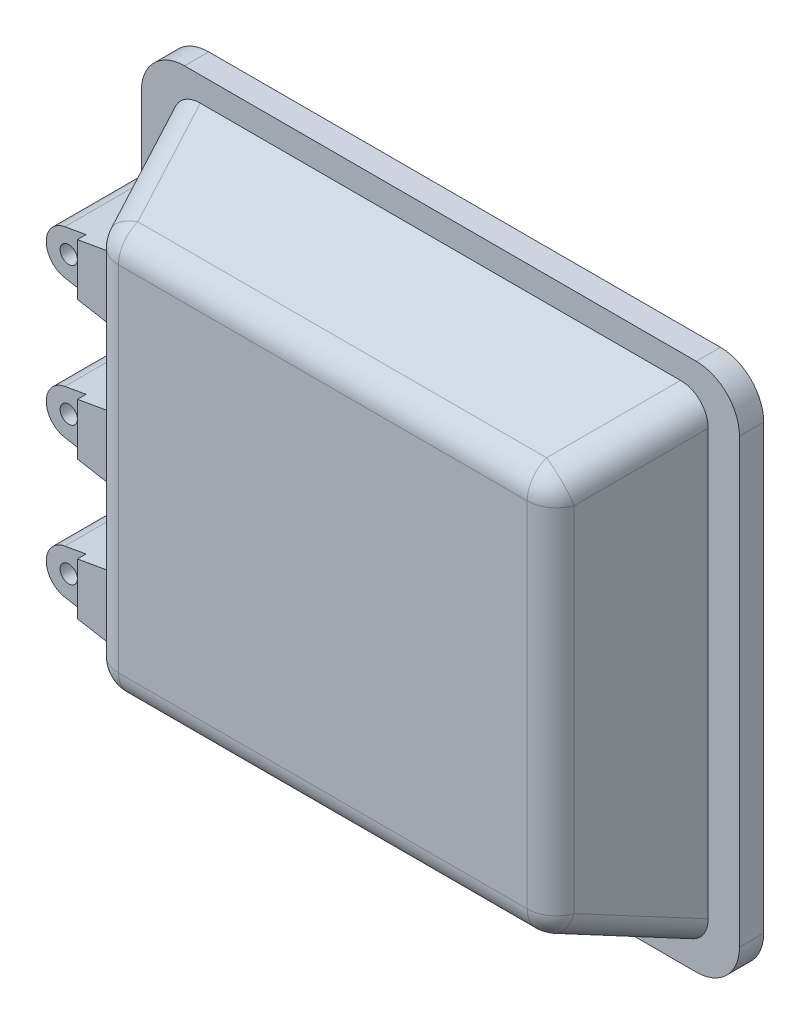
ISO-10303-21;
HEADER;
FILE_DESCRIPTION(('STEP AP214'),'2;1');
FILE_NAME('part.step','',(''),(''),'','','');
FILE_SCHEMA(('AUTOMOTIVE_DESIGN { 1 0 10303 214 1 1 1 1 }'));
ENDSEC;
DATA;
#1=APPLICATION_CONTEXT('core data for automotive mechanical design processes');
#2=APPLICATION_PROTOCOL_DEFINITION('international standard','automotive_design',2000,#1);
#3=PRODUCT_CONTEXT('',#1,'mechanical');
#4=PRODUCT('Part','Part','',(#3));
#5=PRODUCT_RELATED_PRODUCT_CATEGORY('part','',(#4));
#6=PRODUCT_DEFINITION_FORMATION('','',#4);
#7=PRODUCT_DEFINITION_CONTEXT('part definition',#1,'design');
#8=PRODUCT_DEFINITION('design','',#6,#7);
#9=PRODUCT_DEFINITION_SHAPE('','',#8);
#10=(LENGTH_UNIT() NAMED_UNIT(*) SI_UNIT(.MILLI.,.METRE.));
#11=(NAMED_UNIT(*) PLANE_ANGLE_UNIT() SI_UNIT($,.RADIAN.));
#12=(NAMED_UNIT(*) SI_UNIT($,.STERADIAN.) SOLID_ANGLE_UNIT());
#13=UNCERTAINTY_MEASURE_WITH_UNIT(LENGTH_MEASURE(1.E-05),#10,'distance_accuracy_value','');
#14=(GEOMETRIC_REPRESENTATION_CONTEXT(3) GLOBAL_UNCERTAINTY_ASSIGNED_CONTEXT((#13)) GLOBAL_UNIT_ASSIGNED_CONTEXT((#10,
#11,#12)) REPRESENTATION_CONTEXT('',''));
#15=CARTESIAN_POINT('',(0.,0.,0.));
#16=DIRECTION('',(0.,0.,1.));
#17=DIRECTION('',(1.,0.,0.));
#18=AXIS2_PLACEMENT_3D('',#15,#16,#17);
#19=CARTESIAN_POINT('',(173.,153.,14.));
#20=DIRECTION('',(0.,0.,-1.));
#21=DIRECTION('',(-1.,0.,0.));
#22=AXIS2_PLACEMENT_3D('',#19,#20,#21);
#23=PLANE('',#22);
#24=DIRECTION('',(0.,-1.,0.));
#25=VECTOR('',#24,1.);
#26=CARTESIAN_POINT('',(-154.858371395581,129.,14.));
#27=LINE('',#26,#25);
#28=CARTESIAN_POINT('',(-154.858371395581,94.107153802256,14.));
#29=VERTEX_POINT('',#28);
#30=CARTESIAN_POINT('',(-154.858371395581,122.883596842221,14.));
#31=VERTEX_POINT('',#30);
#32=EDGE_CURVE('E473',#29,#31,#27,.F.);
#33=ORIENTED_EDGE('',*,*,#32,.T.);
#34=CARTESIAN_POINT('',(-136.767349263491,120.767349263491,14.));
#35=DIRECTION('',(0.,0.,-1.));
#36=DIRECTION('',(-0.707106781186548,0.707106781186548,0.));
#37=AXIS2_PLACEMENT_3D('',#34,#35,#36);
#38=ELLIPSE('',#37,19.1198892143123,17.);
#39=CARTESIAN_POINT('',(-138.883596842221,138.858371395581,14.));
#40=VERTEX_POINT('',#39);
#41=EDGE_CURVE('E476',#40,#31,#38,.F.);
#42=ORIENTED_EDGE('',*,*,#41,.F.);
#43=DIRECTION('',(-1.,0.,0.));
#44=VECTOR('',#43,1.);
#45=CARTESIAN_POINT('',(145.,138.858371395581,14.));
#46=LINE('',#45,#44);
#47=CARTESIAN_POINT('',(138.883596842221,138.858371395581,14.));
#48=VERTEX_POINT('',#47);
#49=EDGE_CURVE('E479',#40,#48,#46,.F.);
#50=ORIENTED_EDGE('',*,*,#49,.T.);
#51=CARTESIAN_POINT('',(136.767349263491,120.767349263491,14.));
#52=DIRECTION('',(0.,0.,-1.));
#53=DIRECTION('',(0.707106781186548,0.707106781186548,0.));
#54=AXIS2_PLACEMENT_3D('',#51,#52,#53);
#55=ELLIPSE('',#54,19.1198892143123,17.);
#56=CARTESIAN_POINT('',(154.858371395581,122.883596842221,14.));
#57=VERTEX_POINT('',#56);
#58=EDGE_CURVE('E483',#57,#48,#55,.F.);
#59=ORIENTED_EDGE('',*,*,#58,.F.);
#60=DIRECTION('',(0.,1.,0.));
#61=VECTOR('',#60,1.);
#62=CARTESIAN_POINT('',(154.858371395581,-129.,14.));
#63=LINE('',#62,#61);
#64=CARTESIAN_POINT('',(154.858371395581,-122.883596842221,14.));
#65=VERTEX_POINT('',#64);
#66=EDGE_CURVE('E481',#57,#65,#63,.F.);
#67=ORIENTED_EDGE('',*,*,#66,.T.);
#68=CARTESIAN_POINT('',(136.767349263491,-120.767349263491,14.));
#69=DIRECTION('',(0.,0.,-1.));
#70=DIRECTION('',(0.707106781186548,-0.707106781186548,0.));
#71=AXIS2_PLACEMENT_3D('',#68,#69,#70);
#72=ELLIPSE('',#71,19.1198892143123,17.);
#73=CARTESIAN_POINT('',(138.883596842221,-138.858371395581,14.));
#74=VERTEX_POINT('',#73);
#75=EDGE_CURVE('E472',#74,#65,#72,.F.);
#76=ORIENTED_EDGE('',*,*,#75,.F.);
#77=DIRECTION('',(1.,0.,0.));
#78=VECTOR('',#77,1.);
#79=CARTESIAN_POINT('',(-145.,-138.858371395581,14.));
#80=LINE('',#79,#78);
#81=CARTESIAN_POINT('',(-138.883596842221,-138.858371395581,14.));
#82=VERTEX_POINT('',#81);
#83=EDGE_CURVE('E467',#74,#82,#80,.F.);
#84=ORIENTED_EDGE('',*,*,#83,.T.);
#85=CARTESIAN_POINT('',(-136.767349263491,-120.767349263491,14.));
#86=DIRECTION('',(0.,0.,-1.));
#87=DIRECTION('',(-0.707106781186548,-0.707106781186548,0.));
#88=AXIS2_PLACEMENT_3D('',#85,#86,#87);
#89=ELLIPSE('',#88,19.1198892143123,17.);
#90=CARTESIAN_POINT('',(-154.858371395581,-122.883596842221,14.));
#91=VERTEX_POINT('',#90);
#92=EDGE_CURVE('E649',#91,#82,#89,.F.);
#93=ORIENTED_EDGE('',*,*,#92,.F.);
#94=CARTESIAN_POINT('',(-154.858371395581,-94.107153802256,14.));
#95=VERTEX_POINT('',#94);
#96=EDGE_CURVE('E470',#91,#95,#27,.F.);
#97=ORIENTED_EDGE('',*,*,#96,.T.);
#98=DIRECTION('',(0.984807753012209,-0.173648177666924,0.));
#99=VECTOR('',#98,1.);
#100=CARTESIAN_POINT('',(-162.25742630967,-92.8025007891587,14.));
#101=LINE('',#100,#99);
#102=CARTESIAN_POINT('',(-162.25742630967,-92.8025007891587,14.));
#103=VERTEX_POINT('',#102);
#104=EDGE_CURVE('E772',#103,#95,#101,.T.);
#105=ORIENTED_EDGE('',*,*,#104,.F.);
#106=CARTESIAN_POINT('',(-160.,-80.,14.));
#107=DIRECTION('',(0.,0.,1.));
#108=DIRECTION('',(-1.,0.,0.));
#109=AXIS2_PLACEMENT_3D('',#106,#107,#108);
#110=CIRCLE('',#109,12.9999999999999);
#111=CARTESIAN_POINT('',(-173.,-80.,14.));
#112=VERTEX_POINT('',#111);
#113=EDGE_CURVE('E803',#112,#103,#110,.T.);
#114=ORIENTED_EDGE('',*,*,#113,.F.);
#115=DIRECTION('',(0.,-1.,0.));
#116=VECTOR('',#115,1.);
#117=CARTESIAN_POINT('',(-173.,153.,14.));
#118=LINE('',#117,#116);
#119=CARTESIAN_POINT('',(-173.,-128.,14.));
#120=VERTEX_POINT('',#119);
#121=EDGE_CURVE('E756',#112,#120,#118,.T.);
#122=ORIENTED_EDGE('',*,*,#121,.T.);
#123=CARTESIAN_POINT('',(-148.,-128.,14.));
#124=DIRECTION('',(0.,0.,-1.));
#125=DIRECTION('',(-1.,0.,0.));
#126=AXIS2_PLACEMENT_3D('',#123,#124,#125);
#127=CIRCLE('',#126,25.);
#128=CARTESIAN_POINT('',(-148.,-153.,14.));
#129=VERTEX_POINT('',#128);
#130=EDGE_CURVE('E727',#120,#129,#127,.F.);
#131=ORIENTED_EDGE('',*,*,#130,.T.);
#132=DIRECTION('',(1.,0.,0.));
#133=VECTOR('',#132,1.);
#134=CARTESIAN_POINT('',(-173.,-153.,14.));
#135=LINE('',#134,#133);
#136=CARTESIAN_POINT('',(148.,-153.,14.));
#137=VERTEX_POINT('',#136);
#138=EDGE_CURVE('E461',#129,#137,#135,.T.);
#139=ORIENTED_EDGE('',*,*,#138,.T.);
#140=CARTESIAN_POINT('',(148.,-128.,14.));
#141=DIRECTION('',(0.,0.,-1.));
#142=DIRECTION('',(-1.,0.,0.));
#143=AXIS2_PLACEMENT_3D('',#140,#141,#142);
#144=CIRCLE('',#143,25.);
#145=CARTESIAN_POINT('',(173.,-128.,14.));
#146=VERTEX_POINT('',#145);
#147=EDGE_CURVE('E729',#137,#146,#144,.F.);
#148=ORIENTED_EDGE('',*,*,#147,.T.);
#149=DIRECTION('',(0.,1.,0.));
#150=VECTOR('',#149,1.);
#151=CARTESIAN_POINT('',(173.,153.,14.));
#152=LINE('',#151,#150);
#153=CARTESIAN_POINT('',(173.,128.,14.));
#154=VERTEX_POINT('',#153);
#155=EDGE_CURVE('E464',#146,#154,#152,.T.);
#156=ORIENTED_EDGE('',*,*,#155,.T.);
#157=CARTESIAN_POINT('',(148.,128.,14.));
#158=DIRECTION('',(0.,0.,-1.));
#159=DIRECTION('',(-1.,0.,0.));
#160=AXIS2_PLACEMENT_3D('',#157,#158,#159);
#161=CIRCLE('',#160,25.);
#162=CARTESIAN_POINT('',(148.,153.,14.));
#163=VERTEX_POINT('',#162);
#164=EDGE_CURVE('E731',#154,#163,#161,.F.);
#165=ORIENTED_EDGE('',*,*,#164,.T.);
#166=DIRECTION('',(-1.,0.,0.));
#167=VECTOR('',#166,1.);
#168=CARTESIAN_POINT('',(-173.,153.,14.));
#169=LINE('',#168,#167);
#170=CARTESIAN_POINT('',(-148.,153.,14.));
#171=VERTEX_POINT('',#170);
#172=EDGE_CURVE('E455',#163,#171,#169,.T.);
#173=ORIENTED_EDGE('',*,*,#172,.T.);
#174=CARTESIAN_POINT('',(-148.,128.,14.));
#175=DIRECTION('',(0.,0.,-1.));
#176=DIRECTION('',(-1.,0.,0.));
#177=AXIS2_PLACEMENT_3D('',#174,#175,#176);
#178=CIRCLE('',#177,25.);
#179=CARTESIAN_POINT('',(-173.,128.,14.));
#180=VERTEX_POINT('',#179);
#181=EDGE_CURVE('E733',#171,#180,#178,.F.);
#182=ORIENTED_EDGE('',*,*,#181,.T.);
#183=CARTESIAN_POINT('',(-173.,80.,14.));
#184=VERTEX_POINT('',#183);
#185=EDGE_CURVE('E459',#180,#184,#118,.T.);
#186=ORIENTED_EDGE('',*,*,#185,.T.);
#187=CARTESIAN_POINT('',(-160.,80.,14.));
#188=DIRECTION('',(0.,0.,1.));
#189=DIRECTION('',(-1.,0.,0.));
#190=AXIS2_PLACEMENT_3D('',#187,#188,#189);
#191=CIRCLE('',#190,12.9999999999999);
#192=CARTESIAN_POINT('',(-162.25742630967,92.8025007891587,14.));
#193=VERTEX_POINT('',#192);
#194=EDGE_CURVE('E857',#193,#184,#191,.T.);
#195=ORIENTED_EDGE('',*,*,#194,.F.);
#196=DIRECTION('',(-0.984807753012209,-0.173648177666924,0.));
#197=VECTOR('',#196,1.);
#198=CARTESIAN_POINT('',(-115.,101.135260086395,14.));
#199=LINE('',#198,#197);
#200=EDGE_CURVE('E850',#29,#193,#199,.T.);
#201=ORIENTED_EDGE('',*,*,#200,.F.);
#202=EDGE_LOOP('',(#33,#42,#50,#59,#67,#76,#84,#93,#97,#105,#114,#122,#131,#139,#148,#156,#165,
#173,#182,#186,#195,#201));
#203=FACE_BOUND('',#202,.T.);
#204=ADVANCED_FACE('F33',(#203),#23,.F.);
#205=CARTESIAN_POINT('',(-156.276311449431,129.,10.104241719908));
#206=DIRECTION('',(-0.939692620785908,0.,0.342020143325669));
#207=DIRECTION('',(0.342020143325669,0.,0.939692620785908));
#208=AXIS2_PLACEMENT_3D('',#205,#206,#207);
#209=PLANE('',#208);
#210=DIRECTION('',(0.,1.,0.));
#211=VECTOR('',#210,1.);
#212=CARTESIAN_POINT('',(-134.179641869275,129.,70.8143424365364));
#213=LINE('',#212,#211);
#214=CARTESIAN_POINT('',(-134.179641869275,97.7533717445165,70.8143424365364));
#215=VERTEX_POINT('',#214);
#216=CARTESIAN_POINT('',(-134.179641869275,102.204867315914,70.8143424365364));
#217=VERTEX_POINT('',#216);
#218=EDGE_CURVE('E640',#215,#217,#213,.T.);
#219=ORIENTED_EDGE('',*,*,#218,.T.);
#220=DIRECTION('',(-0.323615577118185,0.323615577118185,-0.889126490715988));
#221=VECTOR('',#220,1.);
#222=CARTESIAN_POINT('',(-156.768367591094,124.793593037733,8.75232858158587));
#223=LINE('',#222,#221);
#224=EDGE_CURVE('E634',#217,#31,#223,.T.);
#225=ORIENTED_EDGE('',*,*,#224,.T.);
#226=ORIENTED_EDGE('',*,*,#32,.F.);
#227=DIRECTION('',(0.341399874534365,0.060198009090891,0.937988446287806));
#228=VECTOR('',#227,1.);
#229=CARTESIAN_POINT('',(-153.909942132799,94.2743874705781,16.6057879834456));
#230=LINE('',#229,#228);
#231=EDGE_CURVE('E847',#215,#29,#230,.F.);
#232=ORIENTED_EDGE('',*,*,#231,.F.);
#233=EDGE_LOOP('',(#219,#225,#226,#232));
#234=FACE_BOUND('',#233,.T.);
#235=ADVANCED_FACE('F877',(#234),#209,.T.);
#236=CARTESIAN_POINT('',(-160.,80.,-0.001000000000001));
#237=DIRECTION('',(0.,0.,1.));
#238=DIRECTION('',(1.,0.,0.));
#239=AXIS2_PLACEMENT_3D('',#236,#237,#238);
#240=CYLINDRICAL_SURFACE('',#239,4.99999999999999);
#241=CARTESIAN_POINT('',(-160.,80.,69.));
#242=DIRECTION('',(0.,0.,1.));
#243=DIRECTION('',(1.,0.,0.));
#244=AXIS2_PLACEMENT_3D('',#241,#242,#243);
#245=CIRCLE('',#244,4.99999999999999);
#246=CARTESIAN_POINT('',(-155.,80.,69.));
#247=VERTEX_POINT('',#246);
#248=EDGE_CURVE('E41',#247,#247,#245,.T.);
#249=ORIENTED_EDGE('',*,*,#248,.T.);
#250=EDGE_LOOP('',(#249));
#251=FACE_BOUND('',#250,.T.);
#252=CARTESIAN_POINT('',(-160.,80.,0.));
#253=DIRECTION('',(0.,0.,1.));
#254=DIRECTION('',(1.,0.,0.));
#255=AXIS2_PLACEMENT_3D('',#252,#253,#254);
#256=CIRCLE('',#255,4.99999999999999);
#257=CARTESIAN_POINT('',(-155.,80.,0.));
#258=VERTEX_POINT('',#257);
#259=EDGE_CURVE('E11',#258,#258,#256,.F.);
#260=ORIENTED_EDGE('',*,*,#259,.T.);
#261=EDGE_LOOP('',(#260));
#262=FACE_BOUND('',#261,.T.);
#263=ADVANCED_FACE('F35',(#251,#262),#240,.F.);
#264=CARTESIAN_POINT('',(-160.,80.,69.));
#265=DIRECTION('',(0.,0.,1.));
#266=DIRECTION('',(1.,0.,0.));
#267=AXIS2_PLACEMENT_3D('',#264,#265,#266);
#268=PLANE('',#267);
#269=ORIENTED_EDGE('',*,*,#248,.F.);
#270=EDGE_LOOP('',(#269));
#271=FACE_BOUND('',#270,.T.);
#272=DIRECTION('',(-0.984807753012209,-0.173648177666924,0.));
#273=VECTOR('',#272,1.);
#274=CARTESIAN_POINT('',(-150.,94.9638157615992,69.));
#275=LINE('',#274,#273);
#276=CARTESIAN_POINT('',(-150.,94.9638157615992,69.));
#277=VERTEX_POINT('',#276);
#278=CARTESIAN_POINT('',(-162.25742630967,92.8025007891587,69.));
#279=VERTEX_POINT('',#278);
#280=EDGE_CURVE('E56',#277,#279,#275,.T.);
#281=ORIENTED_EDGE('',*,*,#280,.T.);
#282=CARTESIAN_POINT('',(-160.,80.,69.));
#283=DIRECTION('',(0.,0.,1.));
#284=DIRECTION('',(1.,0.,0.));
#285=AXIS2_PLACEMENT_3D('',#282,#283,#284);
#286=CIRCLE('',#285,12.9999999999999);
#287=CARTESIAN_POINT('',(-162.25742630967,67.1974992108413,69.));
#288=VERTEX_POINT('',#287);
#289=EDGE_CURVE('E855',#279,#288,#286,.T.);
#290=ORIENTED_EDGE('',*,*,#289,.T.);
#291=DIRECTION('',(0.984807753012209,-0.173648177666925,0.));
#292=VECTOR('',#291,1.);
#293=CARTESIAN_POINT('',(-162.25742630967,67.1974992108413,69.));
#294=LINE('',#293,#292);
#295=CARTESIAN_POINT('',(-150.,65.0361842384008,69.));
#296=VERTEX_POINT('',#295);
#297=EDGE_CURVE('E826',#288,#296,#294,.T.);
#298=ORIENTED_EDGE('',*,*,#297,.T.);
#299=DIRECTION('',(0.,1.,0.));
#300=VECTOR('',#299,1.);
#301=CARTESIAN_POINT('',(-150.,94.9638157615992,69.));
#302=LINE('',#301,#300);
#303=EDGE_CURVE('E861',#296,#277,#302,.T.);
#304=ORIENTED_EDGE('',*,*,#303,.T.);
#305=EDGE_LOOP('',(#281,#290,#298,#304));
#306=FACE_BOUND('',#305,.T.);
#307=ADVANCED_FACE('F867',(#271,#306),#268,.T.);
#308=CARTESIAN_POINT('',(-150.,94.9638157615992,69.));
#309=DIRECTION('',(1.,0.,0.));
#310=DIRECTION('',(0.,0.,-1.));
#311=AXIS2_PLACEMENT_3D('',#308,#309,#310);
#312=PLANE('',#311);
#313=DIRECTION('',(0.,1.,0.));
#314=VECTOR('',#313,1.);
#315=CARTESIAN_POINT('',(-150.,94.9638157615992,74.));
#316=LINE('',#315,#314);
#317=CARTESIAN_POINT('',(-150.,65.0361842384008,74.));
#318=VERTEX_POINT('',#317);
#319=CARTESIAN_POINT('',(-150.,94.9638157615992,74.));
#320=VERTEX_POINT('',#319);
#321=EDGE_CURVE('E815',#318,#320,#316,.T.);
#322=ORIENTED_EDGE('',*,*,#321,.T.);
#323=DIRECTION('',(0.,0.,1.));
#324=VECTOR('',#323,1.);
#325=CARTESIAN_POINT('',(-150.,94.9638157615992,69.));
#326=LINE('',#325,#324);
#327=EDGE_CURVE('E841',#277,#320,#326,.T.);
#328=ORIENTED_EDGE('',*,*,#327,.F.);
#329=ORIENTED_EDGE('',*,*,#303,.F.);
#330=DIRECTION('',(0.,0.,1.));
#331=VECTOR('',#330,1.);
#332=CARTESIAN_POINT('',(-150.,65.0361842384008,69.));
#333=LINE('',#332,#331);
#334=EDGE_CURVE('E823',#296,#318,#333,.T.);
#335=ORIENTED_EDGE('',*,*,#334,.T.);
#336=EDGE_LOOP('',(#322,#328,#329,#335));
#337=FACE_BOUND('',#336,.T.);
#338=ADVANCED_FACE('F869',(#337),#312,.F.);
#339=CARTESIAN_POINT('',(-160.,80.,74.));
#340=DIRECTION('',(0.,0.,-1.));
#341=DIRECTION('',(-1.,0.,0.));
#342=AXIS2_PLACEMENT_3D('',#339,#340,#341);
#343=CYLINDRICAL_SURFACE('',#342,12.9999999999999);
#344=ORIENTED_EDGE('',*,*,#289,.F.);
#345=DIRECTION('',(0.,0.,-1.));
#346=VECTOR('',#345,1.);
#347=CARTESIAN_POINT('',(-162.25742630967,92.8025007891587,74.));
#348=LINE('',#347,#346);
#349=EDGE_CURVE('E852',#279,#193,#348,.T.);
#350=ORIENTED_EDGE('',*,*,#349,.T.);
#351=ORIENTED_EDGE('',*,*,#194,.T.);
#352=CARTESIAN_POINT('',(-162.25742630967,67.1974992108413,14.));
#353=VERTEX_POINT('',#352);
#354=EDGE_CURVE('E860',#184,#353,#191,.T.);
#355=ORIENTED_EDGE('',*,*,#354,.T.);
#356=DIRECTION('',(0.,0.,-1.));
#357=VECTOR('',#356,1.);
#358=CARTESIAN_POINT('',(-162.25742630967,67.1974992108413,74.));
#359=LINE('',#358,#357);
#360=EDGE_CURVE('E829',#288,#353,#359,.T.);
#361=ORIENTED_EDGE('',*,*,#360,.F.);
#362=EDGE_LOOP('',(#344,#350,#351,#355,#361));
#363=FACE_BOUND('',#362,.T.);
#364=ADVANCED_FACE('F874',(#363),#343,.T.);
#365=CARTESIAN_POINT('',(-115.,101.135260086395,74.));
#366=DIRECTION('',(0.173648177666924,-0.984807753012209,0.));
#367=DIRECTION('',(0.984807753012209,0.173648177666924,0.));
#368=AXIS2_PLACEMENT_3D('',#365,#366,#367);
#369=PLANE('',#368);
#370=ORIENTED_EDGE('',*,*,#280,.F.);
#371=ORIENTED_EDGE('',*,*,#327,.T.);
#372=DIRECTION('',(-0.984807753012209,-0.173648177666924,0.));
#373=VECTOR('',#372,1.);
#374=CARTESIAN_POINT('',(-115.,101.135260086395,74.));
#375=LINE('',#374,#373);
#376=CARTESIAN_POINT('',(-132.62707241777,98.0271316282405,74.));
#377=VERTEX_POINT('',#376);
#378=EDGE_CURVE('E813',#377,#320,#375,.T.);
#379=ORIENTED_EDGE('',*,*,#378,.F.);
#380=CARTESIAN_POINT('',(-118.204867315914,100.570155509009,65.));
#381=DIRECTION('',(0.173648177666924,-0.984807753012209,0.));
#382=DIRECTION('',(-0.984807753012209,-0.173648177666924,0.));
#383=AXIS2_PLACEMENT_3D('',#380,#381,#382);
#384=ELLIPSE('',#383,17.2622524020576,17.);
#385=EDGE_CURVE('E844',#215,#377,#384,.F.);
#386=ORIENTED_EDGE('',*,*,#385,.F.);
#387=ORIENTED_EDGE('',*,*,#231,.T.);
#388=ORIENTED_EDGE('',*,*,#200,.T.);
#389=ORIENTED_EDGE('',*,*,#349,.F.);
#390=EDGE_LOOP('',(#370,#371,#379,#386,#387,#388,#389));
#391=FACE_BOUND('',#390,.T.);
#392=ADVANCED_FACE('F1036',(#391),#369,.F.);
#393=CARTESIAN_POINT('',(-162.25742630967,67.1974992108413,74.));
#394=DIRECTION('',(0.173648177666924,0.984807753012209,0.));
#395=DIRECTION('',(-0.984807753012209,0.173648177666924,0.));
#396=AXIS2_PLACEMENT_3D('',#393,#394,#395);
#397=PLANE('',#396);
#398=DIRECTION('',(0.984807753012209,-0.173648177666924,0.));
#399=VECTOR('',#398,1.);
#400=CARTESIAN_POINT('',(-162.25742630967,67.1974992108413,74.));
#401=LINE('',#400,#399);
#402=CARTESIAN_POINT('',(-132.62707241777,61.9728683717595,74.));
#403=VERTEX_POINT('',#402);
#404=EDGE_CURVE('E818',#318,#403,#401,.T.);
#405=ORIENTED_EDGE('',*,*,#404,.F.);
#406=ORIENTED_EDGE('',*,*,#334,.F.);
#407=ORIENTED_EDGE('',*,*,#297,.F.);
#408=ORIENTED_EDGE('',*,*,#360,.T.);
#409=DIRECTION('',(0.984807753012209,-0.173648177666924,0.));
#410=VECTOR('',#409,1.);
#411=CARTESIAN_POINT('',(-162.25742630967,67.1974992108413,14.));
#412=LINE('',#411,#410);
#413=CARTESIAN_POINT('',(-154.858371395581,65.892846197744,14.));
#414=VERTEX_POINT('',#413);
#415=EDGE_CURVE('E831',#353,#414,#412,.T.);
#416=ORIENTED_EDGE('',*,*,#415,.T.);
#417=DIRECTION('',(-0.341399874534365,0.0601980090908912,-0.937988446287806));
#418=VECTOR('',#417,1.);
#419=CARTESIAN_POINT('',(-159.212253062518,66.6605530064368,2.03780843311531));
#420=LINE('',#419,#418);
#421=CARTESIAN_POINT('',(-134.179641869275,62.2466282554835,70.8143424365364));
#422=VERTEX_POINT('',#421);
#423=EDGE_CURVE('E834',#414,#422,#420,.F.);
#424=ORIENTED_EDGE('',*,*,#423,.T.);
#425=CARTESIAN_POINT('',(-118.204867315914,59.4298444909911,65.));
#426=DIRECTION('',(0.173648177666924,0.984807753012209,0.));
#427=DIRECTION('',(0.984807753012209,-0.173648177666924,0.));
#428=AXIS2_PLACEMENT_3D('',#425,#426,#427);
#429=ELLIPSE('',#428,17.2622524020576,17.);
#430=EDGE_CURVE('E837',#403,#422,#429,.F.);
#431=ORIENTED_EDGE('',*,*,#430,.F.);
#432=EDGE_LOOP('',(#405,#406,#407,#408,#416,#424,#431));
#433=FACE_BOUND('',#432,.T.);
#434=ADVANCED_FACE('F920',(#433),#397,.F.);
#435=CARTESIAN_POINT('',(-160.,80.,74.));
#436=DIRECTION('',(0.,0.,-1.));
#437=DIRECTION('',(-1.,0.,0.));
#438=AXIS2_PLACEMENT_3D('',#435,#436,#437);
#439=PLANE('',#438);
#440=ORIENTED_EDGE('',*,*,#378,.T.);
#441=ORIENTED_EDGE('',*,*,#321,.F.);
#442=ORIENTED_EDGE('',*,*,#404,.T.);
#443=DIRECTION('',(0.,-1.,0.));
#444=VECTOR('',#443,1.);
#445=CARTESIAN_POINT('',(-132.62707241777,209.,74.));
#446=LINE('',#445,#444);
#447=EDGE_CURVE('E820',#377,#403,#446,.T.);
#448=ORIENTED_EDGE('',*,*,#447,.F.);
#449=EDGE_LOOP('',(#440,#441,#442,#448));
#450=FACE_BOUND('',#449,.T.);
#451=ADVANCED_FACE('F893',(#450),#439,.F.);
#452=CARTESIAN_POINT('',(-154.858371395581,-65.892846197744,14.));
#453=VERTEX_POINT('',#452);
#454=CARTESIAN_POINT('',(-154.858371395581,-14.107153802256,14.));
#455=VERTEX_POINT('',#454);
#456=EDGE_CURVE('E917',#453,#455,#27,.F.);
#457=ORIENTED_EDGE('',*,*,#456,.T.);
#458=DIRECTION('',(0.984807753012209,-0.173648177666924,0.));
#459=VECTOR('',#458,1.);
#460=CARTESIAN_POINT('',(-162.25742630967,-12.8025007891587,14.));
#461=LINE('',#460,#459);
#462=CARTESIAN_POINT('',(-162.25742630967,-12.8025007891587,14.));
#463=VERTEX_POINT('',#462);
#464=EDGE_CURVE('E435',#463,#455,#461,.T.);
#465=ORIENTED_EDGE('',*,*,#464,.F.);
#466=CARTESIAN_POINT('',(-160.,0.,14.));
#467=DIRECTION('',(0.,0.,1.));
#468=DIRECTION('',(-1.,0.,0.));
#469=AXIS2_PLACEMENT_3D('',#466,#467,#468);
#470=CIRCLE('',#469,12.9999999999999);
#471=CARTESIAN_POINT('',(-173.,0.,14.));
#472=VERTEX_POINT('',#471);
#473=EDGE_CURVE('E938',#472,#463,#470,.T.);
#474=ORIENTED_EDGE('',*,*,#473,.F.);
#475=EDGE_CURVE('E458',#472,#112,#118,.T.);
#476=ORIENTED_EDGE('',*,*,#475,.T.);
#477=CARTESIAN_POINT('',(-162.25742630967,-67.1974992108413,14.));
#478=VERTEX_POINT('',#477);
#479=EDGE_CURVE('E800',#478,#112,#110,.T.);
#480=ORIENTED_EDGE('',*,*,#479,.F.);
#481=DIRECTION('',(-0.984807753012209,-0.173648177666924,0.));
#482=VECTOR('',#481,1.);
#483=CARTESIAN_POINT('',(-115.,-58.8647399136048,14.));
#484=LINE('',#483,#482);
#485=EDGE_CURVE('E792',#453,#478,#484,.T.);
#486=ORIENTED_EDGE('',*,*,#485,.F.);
#487=EDGE_LOOP('',(#457,#465,#474,#476,#480,#486));
#488=FACE_BOUND('',#487,.T.);
#489=ADVANCED_FACE('F881',(#488),#23,.F.);
#490=CARTESIAN_POINT('',(-134.179641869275,-62.2466282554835,70.8143424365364));
#491=VERTEX_POINT('',#490);
#492=CARTESIAN_POINT('',(-134.179641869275,-17.7533717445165,70.8143424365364));
#493=VERTEX_POINT('',#492);
#494=EDGE_CURVE('E752',#491,#493,#213,.T.);
#495=ORIENTED_EDGE('',*,*,#494,.T.);
#496=DIRECTION('',(-0.341399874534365,0.0601980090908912,-0.937988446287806));
#497=VECTOR('',#496,1.);
#498=CARTESIAN_POINT('',(-159.212253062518,-13.3394469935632,2.03780843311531));
#499=LINE('',#498,#497);
#500=EDGE_CURVE('E745',#455,#493,#499,.F.);
#501=ORIENTED_EDGE('',*,*,#500,.F.);
#502=ORIENTED_EDGE('',*,*,#456,.F.);
#503=DIRECTION('',(0.341399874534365,0.060198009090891,0.937988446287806));
#504=VECTOR('',#503,1.);
#505=CARTESIAN_POINT('',(-153.909942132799,-65.7256125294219,16.6057879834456));
#506=LINE('',#505,#504);
#507=EDGE_CURVE('E789',#491,#453,#506,.F.);
#508=ORIENTED_EDGE('',*,*,#507,.F.);
#509=EDGE_LOOP('',(#495,#501,#502,#508));
#510=FACE_BOUND('',#509,.T.);
#511=ADVANCED_FACE('F888',(#510),#209,.T.);
#512=CARTESIAN_POINT('',(-160.,-80.,-0.001000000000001));
#513=DIRECTION('',(0.,0.,1.));
#514=DIRECTION('',(1.,0.,0.));
#515=AXIS2_PLACEMENT_3D('',#512,#513,#514);
#516=CYLINDRICAL_SURFACE('',#515,4.99999999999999);
#517=CARTESIAN_POINT('',(-160.,-80.,69.));
#518=DIRECTION('',(0.,0.,1.));
#519=DIRECTION('',(1.,0.,0.));
#520=AXIS2_PLACEMENT_3D('',#517,#518,#519);
#521=CIRCLE('',#520,4.99999999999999);
#522=CARTESIAN_POINT('',(-155.,-80.,69.));
#523=VERTEX_POINT('',#522);
#524=EDGE_CURVE('E807',#523,#523,#521,.T.);
#525=ORIENTED_EDGE('',*,*,#524,.T.);
#526=EDGE_LOOP('',(#525));
#527=FACE_BOUND('',#526,.T.);
#528=CARTESIAN_POINT('',(-160.,-80.,0.));
#529=DIRECTION('',(0.,0.,1.));
#530=DIRECTION('',(1.,0.,0.));
#531=AXIS2_PLACEMENT_3D('',#528,#529,#530);
#532=CIRCLE('',#531,4.99999999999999);
#533=CARTESIAN_POINT('',(-155.,-80.,0.));
#534=VERTEX_POINT('',#533);
#535=EDGE_CURVE('E810',#534,#534,#532,.F.);
#536=ORIENTED_EDGE('',*,*,#535,.T.);
#537=EDGE_LOOP('',(#536));
#538=FACE_BOUND('',#537,.T.);
#539=ADVANCED_FACE('F1026',(#527,#538),#516,.F.);
#540=CARTESIAN_POINT('',(-160.,-80.,69.));
#541=DIRECTION('',(0.,0.,1.));
#542=DIRECTION('',(1.,0.,0.));
#543=AXIS2_PLACEMENT_3D('',#540,#541,#542);
#544=PLANE('',#543);
#545=ORIENTED_EDGE('',*,*,#524,.F.);
#546=EDGE_LOOP('',(#545));
#547=FACE_BOUND('',#546,.T.);
#548=DIRECTION('',(-0.984807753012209,-0.173648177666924,0.));
#549=VECTOR('',#548,1.);
#550=CARTESIAN_POINT('',(-150.,-65.0361842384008,69.));
#551=LINE('',#550,#549);
#552=CARTESIAN_POINT('',(-150.,-65.0361842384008,69.));
#553=VERTEX_POINT('',#552);
#554=CARTESIAN_POINT('',(-162.25742630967,-67.1974992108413,69.));
#555=VERTEX_POINT('',#554);
#556=EDGE_CURVE('E781',#553,#555,#551,.T.);
#557=ORIENTED_EDGE('',*,*,#556,.T.);
#558=CARTESIAN_POINT('',(-160.,-80.,69.));
#559=DIRECTION('',(0.,0.,1.));
#560=DIRECTION('',(1.,0.,0.));
#561=AXIS2_PLACEMENT_3D('',#558,#559,#560);
#562=CIRCLE('',#561,12.9999999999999);
#563=CARTESIAN_POINT('',(-162.25742630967,-92.8025007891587,69.));
#564=VERTEX_POINT('',#563);
#565=EDGE_CURVE('E797',#555,#564,#562,.T.);
#566=ORIENTED_EDGE('',*,*,#565,.T.);
#567=DIRECTION('',(0.984807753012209,-0.173648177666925,0.));
#568=VECTOR('',#567,1.);
#569=CARTESIAN_POINT('',(-162.25742630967,-92.8025007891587,69.));
#570=LINE('',#569,#568);
#571=CARTESIAN_POINT('',(-150.,-94.9638157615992,69.));
#572=VERTEX_POINT('',#571);
#573=EDGE_CURVE('E767',#564,#572,#570,.T.);
#574=ORIENTED_EDGE('',*,*,#573,.T.);
#575=DIRECTION('',(0.,1.,0.));
#576=VECTOR('',#575,1.);
#577=CARTESIAN_POINT('',(-150.,-65.0361842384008,69.));
#578=LINE('',#577,#576);
#579=EDGE_CURVE('E804',#572,#553,#578,.T.);
#580=ORIENTED_EDGE('',*,*,#579,.T.);
#581=EDGE_LOOP('',(#557,#566,#574,#580));
#582=FACE_BOUND('',#581,.T.);
#583=ADVANCED_FACE('F967',(#547,#582),#544,.T.);
#584=CARTESIAN_POINT('',(-150.,-65.0361842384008,69.));
#585=DIRECTION('',(1.,0.,0.));
#586=DIRECTION('',(0.,0.,-1.));
#587=AXIS2_PLACEMENT_3D('',#584,#585,#586);
#588=PLANE('',#587);
#589=DIRECTION('',(0.,1.,0.));
#590=VECTOR('',#589,1.);
#591=CARTESIAN_POINT('',(-150.,-65.0361842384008,74.));
#592=LINE('',#591,#590);
#593=CARTESIAN_POINT('',(-150.,-94.9638157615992,74.));
#594=VERTEX_POINT('',#593);
#595=CARTESIAN_POINT('',(-150.,-65.0361842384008,74.));
#596=VERTEX_POINT('',#595);
#597=EDGE_CURVE('E755',#594,#596,#592,.T.);
#598=ORIENTED_EDGE('',*,*,#597,.T.);
#599=DIRECTION('',(0.,0.,1.));
#600=VECTOR('',#599,1.);
#601=CARTESIAN_POINT('',(-150.,-65.0361842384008,69.));
#602=LINE('',#601,#600);
#603=EDGE_CURVE('E783',#553,#596,#602,.T.);
#604=ORIENTED_EDGE('',*,*,#603,.F.);
#605=ORIENTED_EDGE('',*,*,#579,.F.);
#606=DIRECTION('',(0.,0.,1.));
#607=VECTOR('',#606,1.);
#608=CARTESIAN_POINT('',(-150.,-94.9638157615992,69.));
#609=LINE('',#608,#607);
#610=EDGE_CURVE('E764',#572,#594,#609,.T.);
#611=ORIENTED_EDGE('',*,*,#610,.T.);
#612=EDGE_LOOP('',(#598,#604,#605,#611));
#613=FACE_BOUND('',#612,.T.);
#614=ADVANCED_FACE('F964',(#613),#588,.F.);
#615=CARTESIAN_POINT('',(-160.,-80.,74.));
#616=DIRECTION('',(0.,0.,-1.));
#617=DIRECTION('',(-1.,0.,0.));
#618=AXIS2_PLACEMENT_3D('',#615,#616,#617);
#619=CYLINDRICAL_SURFACE('',#618,12.9999999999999);
#620=ORIENTED_EDGE('',*,*,#565,.F.);
#621=DIRECTION('',(0.,0.,-1.));
#622=VECTOR('',#621,1.);
#623=CARTESIAN_POINT('',(-162.25742630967,-67.1974992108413,74.));
#624=LINE('',#623,#622);
#625=EDGE_CURVE('E794',#555,#478,#624,.T.);
#626=ORIENTED_EDGE('',*,*,#625,.T.);
#627=ORIENTED_EDGE('',*,*,#479,.T.);
#628=ORIENTED_EDGE('',*,*,#113,.T.);
#629=DIRECTION('',(0.,0.,-1.));
#630=VECTOR('',#629,1.);
#631=CARTESIAN_POINT('',(-162.25742630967,-92.8025007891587,74.));
#632=LINE('',#631,#630);
#633=EDGE_CURVE('E770',#564,#103,#632,.T.);
#634=ORIENTED_EDGE('',*,*,#633,.F.);
#635=EDGE_LOOP('',(#620,#626,#627,#628,#634));
#636=FACE_BOUND('',#635,.T.);
#637=ADVANCED_FACE('F943',(#636),#619,.T.);
#638=CARTESIAN_POINT('',(-115.,-58.8647399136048,74.));
#639=DIRECTION('',(0.173648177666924,-0.984807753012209,0.));
#640=DIRECTION('',(0.984807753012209,0.173648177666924,0.));
#641=AXIS2_PLACEMENT_3D('',#638,#639,#640);
#642=PLANE('',#641);
#643=ORIENTED_EDGE('',*,*,#556,.F.);
#644=ORIENTED_EDGE('',*,*,#603,.T.);
#645=DIRECTION('',(-0.984807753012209,-0.173648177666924,0.));
#646=VECTOR('',#645,1.);
#647=CARTESIAN_POINT('',(-115.,-58.8647399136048,74.));
#648=LINE('',#647,#646);
#649=CARTESIAN_POINT('',(-132.62707241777,-61.9728683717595,74.));
#650=VERTEX_POINT('',#649);
#651=EDGE_CURVE('E753',#650,#596,#648,.T.);
#652=ORIENTED_EDGE('',*,*,#651,.F.);
#653=CARTESIAN_POINT('',(-118.204867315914,-59.4298444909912,65.));
#654=DIRECTION('',(0.173648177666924,-0.984807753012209,0.));
#655=DIRECTION('',(-0.984807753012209,-0.173648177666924,0.));
#656=AXIS2_PLACEMENT_3D('',#653,#654,#655);
#657=ELLIPSE('',#656,17.2622524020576,17.);
#658=EDGE_CURVE('E786',#491,#650,#657,.F.);
#659=ORIENTED_EDGE('',*,*,#658,.F.);
#660=ORIENTED_EDGE('',*,*,#507,.T.);
#661=ORIENTED_EDGE('',*,*,#485,.T.);
#662=ORIENTED_EDGE('',*,*,#625,.F.);
#663=EDGE_LOOP('',(#643,#644,#652,#659,#660,#661,#662));
#664=FACE_BOUND('',#663,.T.);
#665=ADVANCED_FACE('F969',(#664),#642,.F.);
#666=CARTESIAN_POINT('',(-162.25742630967,-92.8025007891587,74.));
#667=DIRECTION('',(0.173648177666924,0.984807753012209,0.));
#668=DIRECTION('',(-0.984807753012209,0.173648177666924,0.));
#669=AXIS2_PLACEMENT_3D('',#666,#667,#668);
#670=PLANE('',#669);
#671=DIRECTION('',(0.984807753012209,-0.173648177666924,0.));
#672=VECTOR('',#671,1.);
#673=CARTESIAN_POINT('',(-162.25742630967,-92.8025007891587,74.));
#674=LINE('',#673,#672);
#675=CARTESIAN_POINT('',(-132.62707241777,-98.0271316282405,74.));
#676=VERTEX_POINT('',#675);
#677=EDGE_CURVE('E759',#594,#676,#674,.T.);
#678=ORIENTED_EDGE('',*,*,#677,.F.);
#679=ORIENTED_EDGE('',*,*,#610,.F.);
#680=ORIENTED_EDGE('',*,*,#573,.F.);
#681=ORIENTED_EDGE('',*,*,#633,.T.);
#682=ORIENTED_EDGE('',*,*,#104,.T.);
#683=DIRECTION('',(-0.341399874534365,0.0601980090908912,-0.937988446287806));
#684=VECTOR('',#683,1.);
#685=CARTESIAN_POINT('',(-159.212253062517,-93.3394469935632,2.03780843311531));
#686=LINE('',#685,#684);
#687=CARTESIAN_POINT('',(-134.179641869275,-97.7533717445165,70.8143424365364));
#688=VERTEX_POINT('',#687);
#689=EDGE_CURVE('E775',#95,#688,#686,.F.);
#690=ORIENTED_EDGE('',*,*,#689,.T.);
#691=CARTESIAN_POINT('',(-118.204867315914,-100.570155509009,65.));
#692=DIRECTION('',(0.173648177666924,0.984807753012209,0.));
#693=DIRECTION('',(0.984807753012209,-0.173648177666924,0.));
#694=AXIS2_PLACEMENT_3D('',#691,#692,#693);
#695=ELLIPSE('',#694,17.2622524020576,17.);
#696=EDGE_CURVE('E778',#676,#688,#695,.F.);
#697=ORIENTED_EDGE('',*,*,#696,.F.);
#698=EDGE_LOOP('',(#678,#679,#680,#681,#682,#690,#697));
#699=FACE_BOUND('',#698,.T.);
#700=ADVANCED_FACE('F951',(#699),#670,.F.);
#701=CARTESIAN_POINT('',(-160.,-80.,74.));
#702=DIRECTION('',(0.,0.,-1.));
#703=DIRECTION('',(-1.,0.,0.));
#704=AXIS2_PLACEMENT_3D('',#701,#702,#703);
#705=PLANE('',#704);
#706=ORIENTED_EDGE('',*,*,#651,.T.);
#707=ORIENTED_EDGE('',*,*,#597,.F.);
#708=ORIENTED_EDGE('',*,*,#677,.T.);
#709=DIRECTION('',(0.,-1.,0.));
#710=VECTOR('',#709,1.);
#711=CARTESIAN_POINT('',(-132.62707241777,49.,74.));
#712=LINE('',#711,#710);
#713=EDGE_CURVE('E761',#650,#676,#712,.T.);
#714=ORIENTED_EDGE('',*,*,#713,.F.);
#715=EDGE_LOOP('',(#706,#707,#708,#714));
#716=FACE_BOUND('',#715,.T.);
#717=ADVANCED_FACE('F1004',(#716),#705,.F.);
#718=CARTESIAN_POINT('',(-160.,0.,74.));
#719=DIRECTION('',(0.,0.,-1.));
#720=DIRECTION('',(-1.,0.,0.));
#721=AXIS2_PLACEMENT_3D('',#718,#719,#720);
#722=CYLINDRICAL_SURFACE('',#721,12.9999999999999);
#723=CARTESIAN_POINT('',(-160.,0.,69.));
#724=DIRECTION('',(0.,0.,1.));
#725=DIRECTION('',(1.,0.,0.));
#726=AXIS2_PLACEMENT_3D('',#723,#724,#725);
#727=CIRCLE('',#726,12.9999999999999);
#728=CARTESIAN_POINT('',(-162.25742630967,12.8025007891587,69.));
#729=VERTEX_POINT('',#728);
#730=CARTESIAN_POINT('',(-162.25742630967,-12.8025007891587,69.));
#731=VERTEX_POINT('',#730);
#732=EDGE_CURVE('E981',#729,#731,#727,.T.);
#733=ORIENTED_EDGE('',*,*,#732,.F.);
#734=DIRECTION('',(0.,0.,-1.));
#735=VECTOR('',#734,1.);
#736=CARTESIAN_POINT('',(-162.25742630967,12.8025007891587,74.));
#737=LINE('',#736,#735);
#738=CARTESIAN_POINT('',(-162.25742630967,12.8025007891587,14.));
#739=VERTEX_POINT('',#738);
#740=EDGE_CURVE('E433',#729,#739,#737,.T.);
#741=ORIENTED_EDGE('',*,*,#740,.T.);
#742=EDGE_CURVE('E973',#739,#472,#470,.T.);
#743=ORIENTED_EDGE('',*,*,#742,.T.);
#744=ORIENTED_EDGE('',*,*,#473,.T.);
#745=DIRECTION('',(0.,0.,-1.));
#746=VECTOR('',#745,1.);
#747=CARTESIAN_POINT('',(-162.25742630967,-12.8025007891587,74.));
#748=LINE('',#747,#746);
#749=EDGE_CURVE('E431',#731,#463,#748,.T.);
#750=ORIENTED_EDGE('',*,*,#749,.F.);
#751=EDGE_LOOP('',(#733,#741,#743,#744,#750));
#752=FACE_BOUND('',#751,.T.);
#753=ADVANCED_FACE('F1002',(#752),#722,.T.);
#754=CARTESIAN_POINT('',(-145.,129.,6.));
#755=DIRECTION('',(-0.939692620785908,0.,0.342020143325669));
#756=DIRECTION('',(0.342020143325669,0.,0.939692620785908));
#757=AXIS2_PLACEMENT_3D('',#754,#755,#756);
#758=PLANE('',#757);
#759=DIRECTION('',(0.323615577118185,-0.323615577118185,0.889126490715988));
#760=VECTOR('',#759,1.);
#761=CARTESIAN_POINT('',(-145.492056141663,124.793593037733,4.64808686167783));
#762=LINE('',#761,#760);
#763=CARTESIAN_POINT('',(-122.903330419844,102.204867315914,66.7101007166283));
#764=VERTEX_POINT('',#763);
#765=CARTESIAN_POINT('',(-144.991410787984,124.292947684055,6.02359866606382));
#766=VERTEX_POINT('',#765);
#767=EDGE_CURVE('E551',#764,#766,#762,.F.);
#768=ORIENTED_EDGE('',*,*,#767,.F.);
#769=DIRECTION('',(0.,-1.,0.));
#770=VECTOR('',#769,1.);
#771=CARTESIAN_POINT('',(-122.903330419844,101.007441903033,66.7101007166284));
#772=LINE('',#771,#770);
#773=CARTESIAN_POINT('',(-122.903330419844,-102.204867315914,66.7101007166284));
#774=VERTEX_POINT('',#773);
#775=EDGE_CURVE('E625',#774,#764,#772,.F.);
#776=ORIENTED_EDGE('',*,*,#775,.F.);
#777=DIRECTION('',(0.323615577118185,0.323615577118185,0.889126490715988));
#778=VECTOR('',#777,1.);
#779=CARTESIAN_POINT('',(-118.47247936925,-97.7740162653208,78.8837639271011));
#780=LINE('',#779,#778);
#781=CARTESIAN_POINT('',(-144.991410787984,-124.292947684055,6.02359866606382));
#782=VERTEX_POINT('',#781);
#783=EDGE_CURVE('E546',#782,#774,#780,.T.);
#784=ORIENTED_EDGE('',*,*,#783,.F.);
#785=CARTESIAN_POINT('',(-140.,-124.,19.7373870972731));
#786=DIRECTION('',(-0.939692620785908,0.,0.342020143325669));
#787=DIRECTION('',(-0.342020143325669,0.,-0.939692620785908));
#788=AXIS2_PLACEMENT_3D('',#785,#786,#787);
#789=ELLIPSE('',#788,14.6190220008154,5.);
#790=CARTESIAN_POINT('',(-145.,-124.,6.));
#791=VERTEX_POINT('',#790);
#792=EDGE_CURVE('E544',#791,#782,#789,.T.);
#793=ORIENTED_EDGE('',*,*,#792,.F.);
#794=DIRECTION('',(0.,-1.,0.));
#795=VECTOR('',#794,1.);
#796=CARTESIAN_POINT('',(-145.,129.,6.));
#797=LINE('',#796,#795);
#798=CARTESIAN_POINT('',(-145.,124.,6.));
#799=VERTEX_POINT('',#798);
#800=EDGE_CURVE('E532',#799,#791,#797,.T.);
#801=ORIENTED_EDGE('',*,*,#800,.F.);
#802=CARTESIAN_POINT('',(-140.,124.,19.7373870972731));
#803=DIRECTION('',(-0.939692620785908,0.,0.342020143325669));
#804=DIRECTION('',(-0.342020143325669,0.,-0.939692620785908));
#805=AXIS2_PLACEMENT_3D('',#802,#803,#804);
#806=ELLIPSE('',#805,14.6190220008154,5.);
#807=EDGE_CURVE('E549',#766,#799,#806,.T.);
#808=ORIENTED_EDGE('',*,*,#807,.F.);
#809=EDGE_LOOP('',(#768,#776,#784,#793,#801,#808));
#810=FACE_BOUND('',#809,.T.);
#811=ADVANCED_FACE('F1011',(#810),#758,.F.);
#812=CARTESIAN_POINT('',(145.,129.,70.));
#813=DIRECTION('',(0.,0.,1.));
#814=DIRECTION('',(1.,0.,0.));
#815=AXIS2_PLACEMENT_3D('',#812,#813,#814);
#816=PLANE('',#815);
#817=DIRECTION('',(-1.,0.,0.));
#818=VECTOR('',#817,1.);
#819=CARTESIAN_POINT('',(117.007441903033,-102.204867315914,70.));
#820=LINE('',#819,#818);
#821=CARTESIAN_POINT('',(-118.204867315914,-102.204867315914,70.));
#822=VERTEX_POINT('',#821);
#823=CARTESIAN_POINT('',(118.204867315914,-102.204867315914,70.));
#824=VERTEX_POINT('',#823);
#825=EDGE_CURVE('E612',#822,#824,#820,.F.);
#826=ORIENTED_EDGE('',*,*,#825,.F.);
#827=DIRECTION('',(0.,1.,0.));
#828=VECTOR('',#827,1.);
#829=CARTESIAN_POINT('',(-118.204867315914,-101.007441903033,70.));
#830=LINE('',#829,#828);
#831=CARTESIAN_POINT('',(-118.204867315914,102.204867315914,70.));
#832=VERTEX_POINT('',#831);
#833=EDGE_CURVE('E610',#832,#822,#830,.F.);
#834=ORIENTED_EDGE('',*,*,#833,.F.);
#835=DIRECTION('',(1.,0.,0.));
#836=VECTOR('',#835,1.);
#837=CARTESIAN_POINT('',(-117.007441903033,102.204867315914,70.));
#838=LINE('',#837,#836);
#839=CARTESIAN_POINT('',(118.204867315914,102.204867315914,70.));
#840=VERTEX_POINT('',#839);
#841=EDGE_CURVE('E608',#840,#832,#838,.F.);
#842=ORIENTED_EDGE('',*,*,#841,.F.);
#843=DIRECTION('',(0.,-1.,0.));
#844=VECTOR('',#843,1.);
#845=CARTESIAN_POINT('',(118.204867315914,101.007441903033,70.));
#846=LINE('',#845,#844);
#847=EDGE_CURVE('E614',#824,#840,#846,.F.);
#848=ORIENTED_EDGE('',*,*,#847,.F.);
#849=EDGE_LOOP('',(#826,#834,#842,#848));
#850=FACE_BOUND('',#849,.T.);
#851=ADVANCED_FACE('F905',(#850),#816,.F.);
#852=CARTESIAN_POINT('',(-118.204867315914,129.,65.));
#853=DIRECTION('',(0.,-1.,0.));
#854=DIRECTION('',(0.,0.,-1.));
#855=AXIS2_PLACEMENT_3D('',#852,#853,#854);
#856=CYLINDRICAL_SURFACE('',#855,5.);
#857=ORIENTED_EDGE('',*,*,#775,.T.);
#858=CARTESIAN_POINT('',(-118.204867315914,102.204867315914,65.));
#859=DIRECTION('',(0.,1.,0.));
#860=DIRECTION('',(0.,0.,1.));
#861=AXIS2_PLACEMENT_3D('',#858,#859,#860);
#862=CIRCLE('',#861,5.);
#863=EDGE_CURVE('E496',#764,#832,#862,.T.);
#864=ORIENTED_EDGE('',*,*,#863,.T.);
#865=ORIENTED_EDGE('',*,*,#833,.T.);
#866=CARTESIAN_POINT('',(-118.204867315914,-102.204867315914,65.));
#867=DIRECTION('',(0.,1.,0.));
#868=DIRECTION('',(-1.,0.,0.));
#869=AXIS2_PLACEMENT_3D('',#866,#867,#868);
#870=CIRCLE('',#869,5.);
#871=EDGE_CURVE('E502',#774,#822,#870,.T.);
#872=ORIENTED_EDGE('',*,*,#871,.F.);
#873=EDGE_LOOP('',(#857,#864,#865,#872));
#874=FACE_BOUND('',#873,.T.);
#875=ADVANCED_FACE('F897',(#874),#856,.F.);
#876=CARTESIAN_POINT('',(-154.858371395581,14.107153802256,14.));
#877=VERTEX_POINT('',#876);
#878=EDGE_CURVE('E469',#877,#414,#27,.F.);
#879=ORIENTED_EDGE('',*,*,#878,.T.);
#880=ORIENTED_EDGE('',*,*,#415,.F.);
#881=ORIENTED_EDGE('',*,*,#354,.F.);
#882=EDGE_CURVE('E48',#184,#472,#118,.T.);
#883=ORIENTED_EDGE('',*,*,#882,.T.);
#884=ORIENTED_EDGE('',*,*,#742,.F.);
#885=DIRECTION('',(-0.984807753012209,-0.173648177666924,0.));
#886=VECTOR('',#885,1.);
#887=CARTESIAN_POINT('',(-115.,21.1352600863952,14.));
#888=LINE('',#887,#886);
#889=EDGE_CURVE('E914',#877,#739,#888,.T.);
#890=ORIENTED_EDGE('',*,*,#889,.F.);
#891=EDGE_LOOP('',(#879,#880,#881,#883,#884,#890));
#892=FACE_BOUND('',#891,.T.);
#893=ADVANCED_FACE('F882',(#892),#23,.F.);
#894=CARTESIAN_POINT('',(-118.204867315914,129.,65.));
#895=DIRECTION('',(0.,-1.,0.));
#896=DIRECTION('',(0.,0.,-1.));
#897=AXIS2_PLACEMENT_3D('',#894,#895,#896);
#898=CYLINDRICAL_SURFACE('',#897,17.);
#899=CARTESIAN_POINT('',(-134.179641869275,17.7533717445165,70.8143424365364));
#900=VERTEX_POINT('',#899);
#901=EDGE_CURVE('E639',#900,#422,#213,.T.);
#902=ORIENTED_EDGE('',*,*,#901,.F.);
#903=CARTESIAN_POINT('',(-118.204867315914,20.5701555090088,65.));
#904=DIRECTION('',(0.173648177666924,-0.984807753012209,0.));
#905=DIRECTION('',(-0.984807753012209,-0.173648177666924,0.));
#906=AXIS2_PLACEMENT_3D('',#903,#904,#905);
#907=ELLIPSE('',#906,17.2622524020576,17.);
#908=CARTESIAN_POINT('',(-132.62707241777,18.0271316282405,74.));
#909=VERTEX_POINT('',#908);
#910=EDGE_CURVE('E441',#900,#909,#907,.F.);
#911=ORIENTED_EDGE('',*,*,#910,.T.);
#912=DIRECTION('',(0.,-1.,0.));
#913=VECTOR('',#912,1.);
#914=CARTESIAN_POINT('',(-132.62707241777,129.,74.));
#915=LINE('',#914,#913);
#916=CARTESIAN_POINT('',(-132.62707241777,-18.0271316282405,74.));
#917=VERTEX_POINT('',#916);
#918=EDGE_CURVE('E750',#909,#917,#915,.T.);
#919=ORIENTED_EDGE('',*,*,#918,.T.);
#920=CARTESIAN_POINT('',(-118.204867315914,-20.5701555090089,65.));
#921=DIRECTION('',(0.173648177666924,0.984807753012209,0.));
#922=DIRECTION('',(0.984807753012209,-0.173648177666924,0.));
#923=AXIS2_PLACEMENT_3D('',#920,#921,#922);
#924=ELLIPSE('',#923,17.2622524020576,17.);
#925=EDGE_CURVE('E430',#917,#493,#924,.F.);
#926=ORIENTED_EDGE('',*,*,#925,.T.);
#927=ORIENTED_EDGE('',*,*,#494,.F.);
#928=ORIENTED_EDGE('',*,*,#658,.T.);
#929=ORIENTED_EDGE('',*,*,#713,.T.);
#930=ORIENTED_EDGE('',*,*,#696,.T.);
#931=CARTESIAN_POINT('',(-134.179641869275,-102.204867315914,70.8143424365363));
#932=VERTEX_POINT('',#931);
#933=EDGE_CURVE('E636',#932,#688,#213,.T.);
#934=ORIENTED_EDGE('',*,*,#933,.F.);
#935=CARTESIAN_POINT('',(-118.204867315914,-102.204867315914,65.));
#936=DIRECTION('',(0.,-1.,0.));
#937=DIRECTION('',(0.,0.,-1.));
#938=AXIS2_PLACEMENT_3D('',#935,#936,#937);
#939=CIRCLE('',#938,17.);
#940=CARTESIAN_POINT('',(-118.204867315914,-102.204867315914,82.));
#941=VERTEX_POINT('',#940);
#942=EDGE_CURVE('E654',#932,#941,#939,.F.);
#943=ORIENTED_EDGE('',*,*,#942,.T.);
#944=DIRECTION('',(0.,1.,0.));
#945=VECTOR('',#944,1.);
#946=CARTESIAN_POINT('',(-118.204867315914,129.,82.));
#947=LINE('',#946,#945);
#948=CARTESIAN_POINT('',(-118.204867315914,102.204867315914,82.));
#949=VERTEX_POINT('',#948);
#950=EDGE_CURVE('E658',#949,#941,#947,.F.);
#951=ORIENTED_EDGE('',*,*,#950,.F.);
#952=CARTESIAN_POINT('',(-118.204867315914,102.204867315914,65.));
#953=DIRECTION('',(0.,1.,0.));
#954=DIRECTION('',(-1.,0.,0.));
#955=AXIS2_PLACEMENT_3D('',#952,#953,#954);
#956=CIRCLE('',#955,17.);
#957=EDGE_CURVE('E662',#217,#949,#956,.T.);
#958=ORIENTED_EDGE('',*,*,#957,.F.);
#959=ORIENTED_EDGE('',*,*,#218,.F.);
#960=ORIENTED_EDGE('',*,*,#385,.T.);
#961=ORIENTED_EDGE('',*,*,#447,.T.);
#962=ORIENTED_EDGE('',*,*,#430,.T.);
#963=EDGE_LOOP('',(#902,#911,#919,#926,#927,#928,#929,#930,#934,#943,#951,#958,#959,#960,#961,#962));
#964=FACE_BOUND('',#963,.T.);
#965=ADVANCED_FACE('F896',(#964),#898,.T.);
#966=ORIENTED_EDGE('',*,*,#901,.T.);
#967=ORIENTED_EDGE('',*,*,#423,.F.);
#968=ORIENTED_EDGE('',*,*,#878,.F.);
#969=DIRECTION('',(0.341399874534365,0.060198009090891,0.937988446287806));
#970=VECTOR('',#969,1.);
#971=CARTESIAN_POINT('',(-153.909942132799,14.2743874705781,16.6057879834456));
#972=LINE('',#971,#970);
#973=EDGE_CURVE('E747',#900,#877,#972,.F.);
#974=ORIENTED_EDGE('',*,*,#973,.F.);
#975=EDGE_LOOP('',(#966,#967,#968,#974));
#976=FACE_BOUND('',#975,.T.);
#977=ADVANCED_FACE('F889',(#976),#209,.T.);
#978=ORIENTED_EDGE('',*,*,#933,.T.);
#979=ORIENTED_EDGE('',*,*,#689,.F.);
#980=ORIENTED_EDGE('',*,*,#96,.F.);
#981=DIRECTION('',(-0.323615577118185,-0.323615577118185,-0.889126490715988));
#982=VECTOR('',#981,1.);
#983=CARTESIAN_POINT('',(-156.768367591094,-124.793593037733,8.75232858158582));
#984=LINE('',#983,#982);
#985=EDGE_CURVE('E632',#91,#932,#984,.F.);
#986=ORIENTED_EDGE('',*,*,#985,.T.);
#987=EDGE_LOOP('',(#978,#979,#980,#986));
#988=FACE_BOUND('',#987,.T.);
#989=ADVANCED_FACE('F954',(#988),#209,.T.);
#990=CARTESIAN_POINT('',(-145.,-129.,0.));
#991=DIRECTION('',(0.,0.,1.));
#992=DIRECTION('',(1.,0.,0.));
#993=AXIS2_PLACEMENT_3D('',#990,#991,#992);
#994=PLANE('',#993);
#995=ORIENTED_EDGE('',*,*,#259,.F.);
#996=EDGE_LOOP('',(#995));
#997=FACE_BOUND('',#996,.T.);
#998=ORIENTED_EDGE('',*,*,#535,.F.);
#999=EDGE_LOOP('',(#998));
#1000=FACE_BOUND('',#999,.T.);
#1001=CARTESIAN_POINT('',(-160.,0.,0.));
#1002=DIRECTION('',(0.,0.,1.));
#1003=DIRECTION('',(1.,0.,0.));
#1004=AXIS2_PLACEMENT_3D('',#1001,#1002,#1003);
#1005=CIRCLE('',#1004,4.99999999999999);
#1006=CARTESIAN_POINT('',(-155.,0.,0.));
#1007=VERTEX_POINT('',#1006);
#1008=EDGE_CURVE('E424',#1007,#1007,#1005,.F.);
#1009=ORIENTED_EDGE('',*,*,#1008,.F.);
#1010=EDGE_LOOP('',(#1009));
#1011=FACE_BOUND('',#1010,.T.);
#1012=DIRECTION('',(-1.,0.,0.));
#1013=VECTOR('',#1012,1.);
#1014=CARTESIAN_POINT('',(-145.,129.,0.));
#1015=LINE('',#1014,#1013);
#1016=CARTESIAN_POINT('',(140.,129.,0.));
#1017=VERTEX_POINT('',#1016);
#1018=CARTESIAN_POINT('',(-140.,129.,0.));
#1019=VERTEX_POINT('',#1018);
#1020=EDGE_CURVE('E529',#1017,#1019,#1015,.T.);
#1021=ORIENTED_EDGE('',*,*,#1020,.T.);
#1022=CARTESIAN_POINT('',(-140.,124.,0.));
#1023=DIRECTION('',(0.,0.,1.));
#1024=DIRECTION('',(1.,0.,0.));
#1025=AXIS2_PLACEMENT_3D('',#1022,#1023,#1024);
#1026=CIRCLE('',#1025,5.);
#1027=CARTESIAN_POINT('',(-145.,124.,0.));
#1028=VERTEX_POINT('',#1027);
#1029=EDGE_CURVE('E572',#1028,#1019,#1026,.F.);
#1030=ORIENTED_EDGE('',*,*,#1029,.F.);
#1031=DIRECTION('',(0.,-1.,0.));
#1032=VECTOR('',#1031,1.);
#1033=CARTESIAN_POINT('',(-145.,129.,0.));
#1034=LINE('',#1033,#1032);
#1035=CARTESIAN_POINT('',(-145.,-124.,0.));
#1036=VERTEX_POINT('',#1035);
#1037=EDGE_CURVE('E520',#1028,#1036,#1034,.T.);
#1038=ORIENTED_EDGE('',*,*,#1037,.T.);
#1039=CARTESIAN_POINT('',(-140.,-124.,0.));
#1040=DIRECTION('',(0.,0.,1.));
#1041=DIRECTION('',(1.,0.,0.));
#1042=AXIS2_PLACEMENT_3D('',#1039,#1040,#1041);
#1043=CIRCLE('',#1042,5.);
#1044=CARTESIAN_POINT('',(-140.,-129.,0.));
#1045=VERTEX_POINT('',#1044);
#1046=EDGE_CURVE('E566',#1045,#1036,#1043,.F.);
#1047=ORIENTED_EDGE('',*,*,#1046,.F.);
#1048=DIRECTION('',(1.,0.,0.));
#1049=VECTOR('',#1048,1.);
#1050=CARTESIAN_POINT('',(-145.,-129.,0.));
#1051=LINE('',#1050,#1049);
#1052=CARTESIAN_POINT('',(140.,-129.,0.));
#1053=VERTEX_POINT('',#1052);
#1054=EDGE_CURVE('E523',#1045,#1053,#1051,.T.);
#1055=ORIENTED_EDGE('',*,*,#1054,.T.);
#1056=CARTESIAN_POINT('',(140.,-124.,0.));
#1057=DIRECTION('',(0.,0.,1.));
#1058=DIRECTION('',(1.,0.,0.));
#1059=AXIS2_PLACEMENT_3D('',#1056,#1057,#1058);
#1060=CIRCLE('',#1059,5.);
#1061=CARTESIAN_POINT('',(145.,-124.,0.));
#1062=VERTEX_POINT('',#1061);
#1063=EDGE_CURVE('E568',#1062,#1053,#1060,.F.);
#1064=ORIENTED_EDGE('',*,*,#1063,.F.);
#1065=DIRECTION('',(0.,1.,0.));
#1066=VECTOR('',#1065,1.);
#1067=CARTESIAN_POINT('',(145.,129.,0.));
#1068=LINE('',#1067,#1066);
#1069=CARTESIAN_POINT('',(145.,124.,0.));
#1070=VERTEX_POINT('',#1069);
#1071=EDGE_CURVE('E526',#1062,#1070,#1068,.T.);
#1072=ORIENTED_EDGE('',*,*,#1071,.T.);
#1073=CARTESIAN_POINT('',(140.,124.,0.));
#1074=DIRECTION('',(0.,0.,1.));
#1075=DIRECTION('',(1.,0.,0.));
#1076=AXIS2_PLACEMENT_3D('',#1073,#1074,#1075);
#1077=CIRCLE('',#1076,5.);
#1078=EDGE_CURVE('E570',#1017,#1070,#1077,.F.);
#1079=ORIENTED_EDGE('',*,*,#1078,.F.);
#1080=EDGE_LOOP('',(#1021,#1030,#1038,#1047,#1055,#1064,#1072,#1079));
#1081=FACE_BOUND('',#1080,.T.);
#1082=DIRECTION('',(0.,-1.,0.));
#1083=VECTOR('',#1082,1.);
#1084=CARTESIAN_POINT('',(-173.,153.,0.));
#1085=LINE('',#1084,#1083);
#1086=CARTESIAN_POINT('',(-173.,128.,0.));
#1087=VERTEX_POINT('',#1086);
#1088=CARTESIAN_POINT('',(-173.,-128.,0.));
#1089=VERTEX_POINT('',#1088);
#1090=EDGE_CURVE('E446',#1087,#1089,#1085,.T.);
#1091=ORIENTED_EDGE('',*,*,#1090,.F.);
#1092=CARTESIAN_POINT('',(-148.,128.,0.));
#1093=DIRECTION('',(0.,0.,1.));
#1094=DIRECTION('',(1.,0.,0.));
#1095=AXIS2_PLACEMENT_3D('',#1092,#1093,#1094);
#1096=CIRCLE('',#1095,25.);
#1097=CARTESIAN_POINT('',(-148.,153.,0.));
#1098=VERTEX_POINT('',#1097);
#1099=EDGE_CURVE('E720',#1087,#1098,#1096,.F.);
#1100=ORIENTED_EDGE('',*,*,#1099,.T.);
#1101=DIRECTION('',(-1.,0.,0.));
#1102=VECTOR('',#1101,1.);
#1103=CARTESIAN_POINT('',(-173.,153.,0.));
#1104=LINE('',#1103,#1102);
#1105=CARTESIAN_POINT('',(148.,153.,0.));
#1106=VERTEX_POINT('',#1105);
#1107=EDGE_CURVE('E443',#1106,#1098,#1104,.T.);
#1108=ORIENTED_EDGE('',*,*,#1107,.F.);
#1109=CARTESIAN_POINT('',(148.,128.,0.));
#1110=DIRECTION('',(0.,0.,1.));
#1111=DIRECTION('',(1.,0.,0.));
#1112=AXIS2_PLACEMENT_3D('',#1109,#1110,#1111);
#1113=CIRCLE('',#1112,25.);
#1114=CARTESIAN_POINT('',(173.,128.,0.));
#1115=VERTEX_POINT('',#1114);
#1116=EDGE_CURVE('E718',#1106,#1115,#1113,.F.);
#1117=ORIENTED_EDGE('',*,*,#1116,.T.);
#1118=DIRECTION('',(0.,1.,0.));
#1119=VECTOR('',#1118,1.);
#1120=CARTESIAN_POINT('',(173.,153.,0.));
#1121=LINE('',#1120,#1119);
#1122=CARTESIAN_POINT('',(173.,-128.,0.));
#1123=VERTEX_POINT('',#1122);
#1124=EDGE_CURVE('E452',#1123,#1115,#1121,.T.);
#1125=ORIENTED_EDGE('',*,*,#1124,.F.);
#1126=CARTESIAN_POINT('',(148.,-128.,0.));
#1127=DIRECTION('',(0.,0.,1.));
#1128=DIRECTION('',(1.,0.,0.));
#1129=AXIS2_PLACEMENT_3D('',#1126,#1127,#1128);
#1130=CIRCLE('',#1129,25.);
#1131=CARTESIAN_POINT('',(148.,-153.,0.));
#1132=VERTEX_POINT('',#1131);
#1133=EDGE_CURVE('E716',#1123,#1132,#1130,.F.);
#1134=ORIENTED_EDGE('',*,*,#1133,.T.);
#1135=DIRECTION('',(1.,0.,0.));
#1136=VECTOR('',#1135,1.);
#1137=CARTESIAN_POINT('',(-173.,-153.,0.));
#1138=LINE('',#1137,#1136);
#1139=CARTESIAN_POINT('',(-148.,-153.,0.));
#1140=VERTEX_POINT('',#1139);
#1141=EDGE_CURVE('E449',#1140,#1132,#1138,.T.);
#1142=ORIENTED_EDGE('',*,*,#1141,.F.);
#1143=CARTESIAN_POINT('',(-148.,-128.,0.));
#1144=DIRECTION('',(0.,0.,1.));
#1145=DIRECTION('',(1.,0.,0.));
#1146=AXIS2_PLACEMENT_3D('',#1143,#1144,#1145);
#1147=CIRCLE('',#1146,25.);
#1148=EDGE_CURVE('E714',#1140,#1089,#1147,.F.);
#1149=ORIENTED_EDGE('',*,*,#1148,.T.);
#1150=EDGE_LOOP('',(#1091,#1100,#1108,#1117,#1125,#1134,#1142,#1149));
#1151=FACE_BOUND('',#1150,.T.);
#1152=ADVANCED_FACE('F1059',(#997,#1000,#1011,#1081,#1151),#994,.F.);
#1153=CARTESIAN_POINT('',(-145.,129.,6.));
#1154=DIRECTION('',(1.,0.,0.));
#1155=DIRECTION('',(0.,0.,-1.));
#1156=AXIS2_PLACEMENT_3D('',#1153,#1154,#1155);
#1157=PLANE('',#1156);
#1158=ORIENTED_EDGE('',*,*,#800,.T.);
#1159=DIRECTION('',(0.,0.,-1.));
#1160=VECTOR('',#1159,1.);
#1161=CARTESIAN_POINT('',(-145.,-124.,6.));
#1162=LINE('',#1161,#1160);
#1163=EDGE_CURVE('E562',#1036,#791,#1162,.F.);
#1164=ORIENTED_EDGE('',*,*,#1163,.F.);
#1165=ORIENTED_EDGE('',*,*,#1037,.F.);
#1166=DIRECTION('',(0.,0.,-1.));
#1167=VECTOR('',#1166,1.);
#1168=CARTESIAN_POINT('',(-145.,124.,6.));
#1169=LINE('',#1168,#1167);
#1170=EDGE_CURVE('E564',#799,#1028,#1169,.T.);
#1171=ORIENTED_EDGE('',*,*,#1170,.F.);
#1172=EDGE_LOOP('',(#1158,#1164,#1165,#1171));
#1173=FACE_BOUND('',#1172,.T.);
#1174=ADVANCED_FACE('F1264',(#1173),#1157,.T.);
#1175=CARTESIAN_POINT('',(-145.,-129.,6.));
#1176=DIRECTION('',(0.,1.,0.));
#1177=DIRECTION('',(0.,0.,1.));
#1178=AXIS2_PLACEMENT_3D('',#1175,#1176,#1177);
#1179=PLANE('',#1178);
#1180=ORIENTED_EDGE('',*,*,#1054,.F.);
#1181=DIRECTION('',(0.,0.,-1.));
#1182=VECTOR('',#1181,1.);
#1183=CARTESIAN_POINT('',(-140.,-129.,6.));
#1184=LINE('',#1183,#1182);
#1185=CARTESIAN_POINT('',(-140.,-129.,6.));
#1186=VERTEX_POINT('',#1185);
#1187=EDGE_CURVE('E600',#1186,#1045,#1184,.T.);
#1188=ORIENTED_EDGE('',*,*,#1187,.F.);
#1189=DIRECTION('',(1.,0.,0.));
#1190=VECTOR('',#1189,1.);
#1191=CARTESIAN_POINT('',(-145.,-129.,6.));
#1192=LINE('',#1191,#1190);
#1193=CARTESIAN_POINT('',(140.,-129.,6.));
#1194=VERTEX_POINT('',#1193);
#1195=EDGE_CURVE('E535',#1186,#1194,#1192,.T.);
#1196=ORIENTED_EDGE('',*,*,#1195,.T.);
#1197=DIRECTION('',(0.,0.,-1.));
#1198=VECTOR('',#1197,1.);
#1199=CARTESIAN_POINT('',(140.,-129.,6.));
#1200=LINE('',#1199,#1198);
#1201=EDGE_CURVE('E603',#1053,#1194,#1200,.F.);
#1202=ORIENTED_EDGE('',*,*,#1201,.F.);
#1203=EDGE_LOOP('',(#1180,#1188,#1196,#1202));
#1204=FACE_BOUND('',#1203,.T.);
#1205=ADVANCED_FACE('F1656',(#1204),#1179,.T.);
#1206=CARTESIAN_POINT('',(145.,129.,6.));
#1207=DIRECTION('',(-1.,0.,0.));
#1208=DIRECTION('',(0.,0.,1.));
#1209=AXIS2_PLACEMENT_3D('',#1206,#1207,#1208);
#1210=PLANE('',#1209);
#1211=ORIENTED_EDGE('',*,*,#1071,.F.);
#1212=DIRECTION('',(0.,0.,-1.));
#1213=VECTOR('',#1212,1.);
#1214=CARTESIAN_POINT('',(145.,-124.,6.));
#1215=LINE('',#1214,#1213);
#1216=CARTESIAN_POINT('',(145.,-124.,6.));
#1217=VERTEX_POINT('',#1216);
#1218=EDGE_CURVE('E587',#1217,#1062,#1215,.T.);
#1219=ORIENTED_EDGE('',*,*,#1218,.F.);
#1220=DIRECTION('',(0.,1.,0.));
#1221=VECTOR('',#1220,1.);
#1222=CARTESIAN_POINT('',(145.,129.,6.));
#1223=LINE('',#1222,#1221);
#1224=CARTESIAN_POINT('',(145.,124.,6.));
#1225=VERTEX_POINT('',#1224);
#1226=EDGE_CURVE('E538',#1217,#1225,#1223,.T.);
#1227=ORIENTED_EDGE('',*,*,#1226,.T.);
#1228=DIRECTION('',(0.,0.,-1.));
#1229=VECTOR('',#1228,1.);
#1230=CARTESIAN_POINT('',(145.,124.,6.));
#1231=LINE('',#1230,#1229);
#1232=EDGE_CURVE('E589',#1070,#1225,#1231,.F.);
#1233=ORIENTED_EDGE('',*,*,#1232,.F.);
#1234=EDGE_LOOP('',(#1211,#1219,#1227,#1233));
#1235=FACE_BOUND('',#1234,.T.);
#1236=ADVANCED_FACE('F1647',(#1235),#1210,.T.);
#1237=CARTESIAN_POINT('',(-145.,129.,6.));
#1238=DIRECTION('',(0.,-1.,0.));
#1239=DIRECTION('',(0.,0.,-1.));
#1240=AXIS2_PLACEMENT_3D('',#1237,#1238,#1239);
#1241=PLANE('',#1240);
#1242=ORIENTED_EDGE('',*,*,#1020,.F.);
#1243=DIRECTION('',(0.,0.,-1.));
#1244=VECTOR('',#1243,1.);
#1245=CARTESIAN_POINT('',(140.,129.,6.));
#1246=LINE('',#1245,#1244);
#1247=CARTESIAN_POINT('',(140.,129.,6.));
#1248=VERTEX_POINT('',#1247);
#1249=EDGE_CURVE('E574',#1248,#1017,#1246,.T.);
#1250=ORIENTED_EDGE('',*,*,#1249,.F.);
#1251=DIRECTION('',(-1.,0.,0.));
#1252=VECTOR('',#1251,1.);
#1253=CARTESIAN_POINT('',(-145.,129.,6.));
#1254=LINE('',#1253,#1252);
#1255=CARTESIAN_POINT('',(-140.,129.,6.));
#1256=VERTEX_POINT('',#1255);
#1257=EDGE_CURVE('E541',#1248,#1256,#1254,.T.);
#1258=ORIENTED_EDGE('',*,*,#1257,.T.);
#1259=DIRECTION('',(0.,0.,-1.));
#1260=VECTOR('',#1259,1.);
#1261=CARTESIAN_POINT('',(-140.,129.,6.));
#1262=LINE('',#1261,#1260);
#1263=EDGE_CURVE('E576',#1019,#1256,#1262,.F.);
#1264=ORIENTED_EDGE('',*,*,#1263,.F.);
#1265=EDGE_LOOP('',(#1242,#1250,#1258,#1264));
#1266=FACE_BOUND('',#1265,.T.);
#1267=ADVANCED_FACE('F1639',(#1266),#1241,.T.);
#1268=CARTESIAN_POINT('',(145.,-129.,6.));
#1269=DIRECTION('',(0.939692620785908,0.,0.342020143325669));
#1270=DIRECTION('',(0.342020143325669,0.,-0.939692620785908));
#1271=AXIS2_PLACEMENT_3D('',#1268,#1269,#1270);
#1272=PLANE('',#1271);
#1273=DIRECTION('',(-0.323615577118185,-0.323615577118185,0.889126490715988));
#1274=VECTOR('',#1273,1.);
#1275=CARTESIAN_POINT('',(118.47247936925,97.7740162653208,78.8837639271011));
#1276=LINE('',#1275,#1274);
#1277=CARTESIAN_POINT('',(144.991410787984,124.292947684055,6.02359866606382));
#1278=VERTEX_POINT('',#1277);
#1279=CARTESIAN_POINT('',(122.903330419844,102.204867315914,66.7101007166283));
#1280=VERTEX_POINT('',#1279);
#1281=EDGE_CURVE('E584',#1278,#1280,#1276,.T.);
#1282=ORIENTED_EDGE('',*,*,#1281,.F.);
#1283=CARTESIAN_POINT('',(140.,124.,19.7373870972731));
#1284=DIRECTION('',(0.939692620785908,0.,0.342020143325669));
#1285=DIRECTION('',(0.342020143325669,0.,-0.939692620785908));
#1286=AXIS2_PLACEMENT_3D('',#1283,#1284,#1285);
#1287=ELLIPSE('',#1286,14.6190220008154,5.);
#1288=EDGE_CURVE('E582',#1225,#1278,#1287,.T.);
#1289=ORIENTED_EDGE('',*,*,#1288,.F.);
#1290=ORIENTED_EDGE('',*,*,#1226,.F.);
#1291=CARTESIAN_POINT('',(140.,-124.,19.7373870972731));
#1292=DIRECTION('',(0.939692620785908,0.,0.342020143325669));
#1293=DIRECTION('',(0.342020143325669,0.,-0.939692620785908));
#1294=AXIS2_PLACEMENT_3D('',#1291,#1292,#1293);
#1295=ELLIPSE('',#1294,14.6190220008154,5.);
#1296=CARTESIAN_POINT('',(144.991410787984,-124.292947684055,6.02359866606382));
#1297=VERTEX_POINT('',#1296);
#1298=EDGE_CURVE('E578',#1297,#1217,#1295,.T.);
#1299=ORIENTED_EDGE('',*,*,#1298,.F.);
#1300=DIRECTION('',(-0.323615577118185,0.323615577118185,0.889126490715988));
#1301=VECTOR('',#1300,1.);
#1302=CARTESIAN_POINT('',(145.492056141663,-124.793593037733,4.64808686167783));
#1303=LINE('',#1302,#1301);
#1304=CARTESIAN_POINT('',(122.903330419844,-102.204867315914,66.7101007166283));
#1305=VERTEX_POINT('',#1304);
#1306=EDGE_CURVE('E580',#1305,#1297,#1303,.F.);
#1307=ORIENTED_EDGE('',*,*,#1306,.F.);
#1308=DIRECTION('',(0.,1.,0.));
#1309=VECTOR('',#1308,1.);
#1310=CARTESIAN_POINT('',(122.903330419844,-101.007441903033,66.7101007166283));
#1311=LINE('',#1310,#1309);
#1312=EDGE_CURVE('E617',#1280,#1305,#1311,.F.);
#1313=ORIENTED_EDGE('',*,*,#1312,.F.);
#1314=EDGE_LOOP('',(#1282,#1289,#1290,#1299,#1307,#1313));
#1315=FACE_BOUND('',#1314,.T.);
#1316=ADVANCED_FACE('F1630',(#1315),#1272,.F.);
#1317=CARTESIAN_POINT('',(145.,129.,6.));
#1318=DIRECTION('',(0.,0.939692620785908,0.342020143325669));
#1319=DIRECTION('',(0.,-0.342020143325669,0.939692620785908));
#1320=AXIS2_PLACEMENT_3D('',#1317,#1318,#1319);
#1321=PLANE('',#1320);
#1322=DIRECTION('',(0.323615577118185,-0.323615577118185,0.889126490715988));
#1323=VECTOR('',#1322,1.);
#1324=CARTESIAN_POINT('',(-110.422750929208,99.1212140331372,88.091289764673));
#1325=LINE('',#1324,#1323);
#1326=CARTESIAN_POINT('',(-140.292947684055,128.991410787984,6.02359866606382));
#1327=VERTEX_POINT('',#1326);
#1328=CARTESIAN_POINT('',(-118.204867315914,106.903330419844,66.7101007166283));
#1329=VERTEX_POINT('',#1328);
#1330=EDGE_CURVE('E559',#1327,#1329,#1325,.T.);
#1331=ORIENTED_EDGE('',*,*,#1330,.F.);
#1332=CARTESIAN_POINT('',(-140.,124.,19.7373870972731));
#1333=DIRECTION('',(0.,0.939692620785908,0.342020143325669));
#1334=DIRECTION('',(0.,0.342020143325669,-0.939692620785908));
#1335=AXIS2_PLACEMENT_3D('',#1332,#1333,#1334);
#1336=ELLIPSE('',#1335,14.6190220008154,5.);
#1337=EDGE_CURVE('E557',#1256,#1327,#1336,.T.);
#1338=ORIENTED_EDGE('',*,*,#1337,.F.);
#1339=ORIENTED_EDGE('',*,*,#1257,.F.);
#1340=CARTESIAN_POINT('',(140.,124.,19.7373870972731));
#1341=DIRECTION('',(0.,0.939692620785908,0.342020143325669));
#1342=DIRECTION('',(0.,0.342020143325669,-0.939692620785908));
#1343=AXIS2_PLACEMENT_3D('',#1340,#1341,#1342);
#1344=ELLIPSE('',#1343,14.6190220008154,5.);
#1345=CARTESIAN_POINT('',(140.292947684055,128.991410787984,6.02359866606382));
#1346=VERTEX_POINT('',#1345);
#1347=EDGE_CURVE('E553',#1346,#1248,#1344,.T.);
#1348=ORIENTED_EDGE('',*,*,#1347,.F.);
#1349=DIRECTION('',(-0.323615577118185,-0.323615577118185,0.889126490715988));
#1350=VECTOR('',#1349,1.);
#1351=CARTESIAN_POINT('',(140.793593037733,129.492056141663,4.64808686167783));
#1352=LINE('',#1351,#1350);
#1353=CARTESIAN_POINT('',(118.204867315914,106.903330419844,66.7101007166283));
#1354=VERTEX_POINT('',#1353);
#1355=EDGE_CURVE('E555',#1354,#1346,#1352,.F.);
#1356=ORIENTED_EDGE('',*,*,#1355,.F.);
#1357=DIRECTION('',(-1.,0.,0.));
#1358=VECTOR('',#1357,1.);
#1359=CARTESIAN_POINT('',(117.007441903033,106.903330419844,66.7101007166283));
#1360=LINE('',#1359,#1358);
#1361=EDGE_CURVE('E629',#1329,#1354,#1360,.F.);
#1362=ORIENTED_EDGE('',*,*,#1361,.F.);
#1363=EDGE_LOOP('',(#1331,#1338,#1339,#1348,#1356,#1362));
#1364=FACE_BOUND('',#1363,.T.);
#1365=ADVANCED_FACE('F1621',(#1364),#1321,.F.);
#1366=CARTESIAN_POINT('',(-145.,-129.,6.));
#1367=DIRECTION('',(0.,-0.939692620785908,0.342020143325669));
#1368=DIRECTION('',(0.,-0.342020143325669,-0.939692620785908));
#1369=AXIS2_PLACEMENT_3D('',#1366,#1367,#1368);
#1370=PLANE('',#1369);
#1371=DIRECTION('',(-0.323615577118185,0.323615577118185,0.889126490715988));
#1372=VECTOR('',#1371,1.);
#1373=CARTESIAN_POINT('',(110.422750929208,-99.1212140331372,88.091289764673));
#1374=LINE('',#1373,#1372);
#1375=CARTESIAN_POINT('',(140.292947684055,-128.991410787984,6.02359866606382));
#1376=VERTEX_POINT('',#1375);
#1377=CARTESIAN_POINT('',(118.204867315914,-106.903330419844,66.7101007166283));
#1378=VERTEX_POINT('',#1377);
#1379=EDGE_CURVE('E597',#1376,#1378,#1374,.T.);
#1380=ORIENTED_EDGE('',*,*,#1379,.F.);
#1381=CARTESIAN_POINT('',(140.,-124.,19.7373870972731));
#1382=DIRECTION('',(0.,-0.939692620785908,0.342020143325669));
#1383=DIRECTION('',(0.,-0.342020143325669,-0.939692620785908));
#1384=AXIS2_PLACEMENT_3D('',#1381,#1382,#1383);
#1385=ELLIPSE('',#1384,14.6190220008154,5.);
#1386=EDGE_CURVE('E595',#1194,#1376,#1385,.T.);
#1387=ORIENTED_EDGE('',*,*,#1386,.F.);
#1388=ORIENTED_EDGE('',*,*,#1195,.F.);
#1389=CARTESIAN_POINT('',(-140.,-124.,19.7373870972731));
#1390=DIRECTION('',(0.,-0.939692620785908,0.342020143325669));
#1391=DIRECTION('',(0.,-0.342020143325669,-0.939692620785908));
#1392=AXIS2_PLACEMENT_3D('',#1389,#1390,#1391);
#1393=ELLIPSE('',#1392,14.6190220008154,5.);
#1394=CARTESIAN_POINT('',(-140.292947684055,-128.991410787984,6.02359866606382));
#1395=VERTEX_POINT('',#1394);
#1396=EDGE_CURVE('E591',#1395,#1186,#1393,.T.);
#1397=ORIENTED_EDGE('',*,*,#1396,.F.);
#1398=DIRECTION('',(0.323615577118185,0.323615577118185,0.889126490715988));
#1399=VECTOR('',#1398,1.);
#1400=CARTESIAN_POINT('',(-140.793593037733,-129.492056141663,4.64808686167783));
#1401=LINE('',#1400,#1399);
#1402=CARTESIAN_POINT('',(-118.204867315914,-106.903330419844,66.7101007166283));
#1403=VERTEX_POINT('',#1402);
#1404=EDGE_CURVE('E593',#1403,#1395,#1401,.F.);
#1405=ORIENTED_EDGE('',*,*,#1404,.F.);
#1406=DIRECTION('',(1.,0.,0.));
#1407=VECTOR('',#1406,1.);
#1408=CARTESIAN_POINT('',(-117.007441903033,-106.903330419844,66.7101007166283));
#1409=LINE('',#1408,#1407);
#1410=EDGE_CURVE('E621',#1378,#1403,#1409,.F.);
#1411=ORIENTED_EDGE('',*,*,#1410,.F.);
#1412=EDGE_LOOP('',(#1380,#1387,#1388,#1397,#1405,#1411));
#1413=FACE_BOUND('',#1412,.T.);
#1414=ADVANCED_FACE('F1612',(#1413),#1370,.F.);
#1415=CARTESIAN_POINT('',(-140.,124.,6.));
#1416=DIRECTION('',(0.,0.,-1.));
#1417=DIRECTION('',(-1.,0.,0.));
#1418=AXIS2_PLACEMENT_3D('',#1415,#1416,#1417);
#1419=CYLINDRICAL_SURFACE('',#1418,5.);
#1420=ORIENTED_EDGE('',*,*,#1170,.T.);
#1421=ORIENTED_EDGE('',*,*,#1029,.T.);
#1422=ORIENTED_EDGE('',*,*,#1263,.T.);
#1423=ORIENTED_EDGE('',*,*,#1337,.T.);
#1424=CARTESIAN_POINT('',(-140.,124.,5.11836509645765));
#1425=DIRECTION('',(-0.16648836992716,0.16648836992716,-0.971886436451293));
#1426=DIRECTION('',(0.687227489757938,-0.687227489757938,-0.235450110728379));
#1427=AXIS2_PLACEMENT_3D('',#1424,#1425,#1426);
#1428=ELLIPSE('',#1427,5.14463399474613,5.);
#1429=EDGE_CURVE('E517',#1327,#766,#1428,.F.);
#1430=ORIENTED_EDGE('',*,*,#1429,.T.);
#1431=ORIENTED_EDGE('',*,*,#807,.T.);
#1432=EDGE_LOOP('',(#1420,#1421,#1422,#1423,#1430,#1431));
#1433=FACE_BOUND('',#1432,.T.);
#1434=ADVANCED_FACE('F1603',(#1433),#1419,.F.);
#1435=CARTESIAN_POINT('',(-140.793593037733,124.793593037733,2.93798614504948));
#1436=DIRECTION('',(-0.323615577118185,0.323615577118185,-0.889126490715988));
#1437=DIRECTION('',(-0.939692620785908,0.,0.342020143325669));
#1438=AXIS2_PLACEMENT_3D('',#1435,#1436,#1437);
#1439=CYLINDRICAL_SURFACE('',#1438,5.);
#1440=ORIENTED_EDGE('',*,*,#767,.T.);
#1441=ORIENTED_EDGE('',*,*,#1429,.F.);
#1442=ORIENTED_EDGE('',*,*,#1330,.T.);
#1443=CARTESIAN_POINT('',(-118.204867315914,102.204867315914,65.));
#1444=DIRECTION('',(-0.323615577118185,0.323615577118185,-0.889126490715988));
#1445=DIRECTION('',(-0.939692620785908,0.,0.342020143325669));
#1446=AXIS2_PLACEMENT_3D('',#1443,#1444,#1445);
#1447=CIRCLE('',#1446,5.);
#1448=EDGE_CURVE('E627',#764,#1329,#1447,.T.);
#1449=ORIENTED_EDGE('',*,*,#1448,.F.);
#1450=EDGE_LOOP('',(#1440,#1441,#1442,#1449));
#1451=FACE_BOUND('',#1450,.T.);
#1452=ADVANCED_FACE('F1594',(#1451),#1439,.F.);
#1453=CARTESIAN_POINT('',(140.,124.,6.));
#1454=DIRECTION('',(0.,0.,-1.));
#1455=DIRECTION('',(-1.,0.,0.));
#1456=AXIS2_PLACEMENT_3D('',#1453,#1454,#1455);
#1457=CYLINDRICAL_SURFACE('',#1456,5.);
#1458=ORIENTED_EDGE('',*,*,#1249,.T.);
#1459=ORIENTED_EDGE('',*,*,#1078,.T.);
#1460=ORIENTED_EDGE('',*,*,#1232,.T.);
#1461=ORIENTED_EDGE('',*,*,#1288,.T.);
#1462=CARTESIAN_POINT('',(140.,124.,5.11836509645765));
#1463=DIRECTION('',(0.16648836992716,0.16648836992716,-0.971886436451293));
#1464=DIRECTION('',(-0.687227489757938,-0.687227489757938,-0.235450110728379));
#1465=AXIS2_PLACEMENT_3D('',#1462,#1463,#1464);
#1466=ELLIPSE('',#1465,5.14463399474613,5.);
#1467=EDGE_CURVE('E514',#1278,#1346,#1466,.F.);
#1468=ORIENTED_EDGE('',*,*,#1467,.T.);
#1469=ORIENTED_EDGE('',*,*,#1347,.T.);
#1470=EDGE_LOOP('',(#1458,#1459,#1460,#1461,#1468,#1469));
#1471=FACE_BOUND('',#1470,.T.);
#1472=ADVANCED_FACE('F1584',(#1471),#1457,.F.);
#1473=CARTESIAN_POINT('',(140.793593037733,124.793593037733,2.93798614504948));
#1474=DIRECTION('',(0.323615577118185,0.323615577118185,-0.889126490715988));
#1475=DIRECTION('',(-0.939692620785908,0.,-0.342020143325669));
#1476=AXIS2_PLACEMENT_3D('',#1473,#1474,#1475);
#1477=CYLINDRICAL_SURFACE('',#1476,5.);
#1478=ORIENTED_EDGE('',*,*,#1355,.T.);
#1479=ORIENTED_EDGE('',*,*,#1467,.F.);
#1480=ORIENTED_EDGE('',*,*,#1281,.T.);
#1481=CARTESIAN_POINT('',(118.204867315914,102.204867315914,65.));
#1482=DIRECTION('',(0.323615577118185,0.323615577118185,-0.889126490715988));
#1483=DIRECTION('',(-0.939692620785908,0.,-0.342020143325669));
#1484=AXIS2_PLACEMENT_3D('',#1481,#1482,#1483);
#1485=CIRCLE('',#1484,5.);
#1486=EDGE_CURVE('E605',#1354,#1280,#1485,.T.);
#1487=ORIENTED_EDGE('',*,*,#1486,.F.);
#1488=EDGE_LOOP('',(#1478,#1479,#1480,#1487));
#1489=FACE_BOUND('',#1488,.T.);
#1490=ADVANCED_FACE('F1574',(#1489),#1477,.F.);
#1491=CARTESIAN_POINT('',(140.,-124.,6.));
#1492=DIRECTION('',(0.,0.,-1.));
#1493=DIRECTION('',(-1.,0.,0.));
#1494=AXIS2_PLACEMENT_3D('',#1491,#1492,#1493);
#1495=CYLINDRICAL_SURFACE('',#1494,5.);
#1496=ORIENTED_EDGE('',*,*,#1218,.T.);
#1497=ORIENTED_EDGE('',*,*,#1063,.T.);
#1498=ORIENTED_EDGE('',*,*,#1201,.T.);
#1499=ORIENTED_EDGE('',*,*,#1386,.T.);
#1500=CARTESIAN_POINT('',(140.,-124.,5.11836509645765));
#1501=DIRECTION('',(0.16648836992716,-0.16648836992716,-0.971886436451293));
#1502=DIRECTION('',(-0.687227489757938,0.687227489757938,-0.235450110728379));
#1503=AXIS2_PLACEMENT_3D('',#1500,#1501,#1502);
#1504=ELLIPSE('',#1503,5.14463399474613,5.);
#1505=EDGE_CURVE('E511',#1376,#1297,#1504,.F.);
#1506=ORIENTED_EDGE('',*,*,#1505,.T.);
#1507=ORIENTED_EDGE('',*,*,#1298,.T.);
#1508=EDGE_LOOP('',(#1496,#1497,#1498,#1499,#1506,#1507));
#1509=FACE_BOUND('',#1508,.T.);
#1510=ADVANCED_FACE('F1564',(#1509),#1495,.F.);
#1511=CARTESIAN_POINT('',(140.793593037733,-124.793593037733,2.93798614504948));
#1512=DIRECTION('',(0.323615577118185,-0.323615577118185,-0.889126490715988));
#1513=DIRECTION('',(-0.939692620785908,0.,-0.342020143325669));
#1514=AXIS2_PLACEMENT_3D('',#1511,#1512,#1513);
#1515=CYLINDRICAL_SURFACE('',#1514,5.);
#1516=ORIENTED_EDGE('',*,*,#1306,.T.);
#1517=ORIENTED_EDGE('',*,*,#1505,.F.);
#1518=ORIENTED_EDGE('',*,*,#1379,.T.);
#1519=CARTESIAN_POINT('',(118.204867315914,-102.204867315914,65.));
#1520=DIRECTION('',(0.323615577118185,-0.323615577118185,-0.889126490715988));
#1521=DIRECTION('',(-0.939692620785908,0.,-0.342020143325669));
#1522=AXIS2_PLACEMENT_3D('',#1519,#1520,#1521);
#1523=CIRCLE('',#1522,5.);
#1524=EDGE_CURVE('E619',#1305,#1378,#1523,.T.);
#1525=ORIENTED_EDGE('',*,*,#1524,.F.);
#1526=EDGE_LOOP('',(#1516,#1517,#1518,#1525));
#1527=FACE_BOUND('',#1526,.T.);
#1528=ADVANCED_FACE('F1554',(#1527),#1515,.F.);
#1529=CARTESIAN_POINT('',(-140.,-124.,6.));
#1530=DIRECTION('',(0.,0.,-1.));
#1531=DIRECTION('',(-1.,0.,0.));
#1532=AXIS2_PLACEMENT_3D('',#1529,#1530,#1531);
#1533=CYLINDRICAL_SURFACE('',#1532,5.);
#1534=ORIENTED_EDGE('',*,*,#1187,.T.);
#1535=ORIENTED_EDGE('',*,*,#1046,.T.);
#1536=ORIENTED_EDGE('',*,*,#1163,.T.);
#1537=ORIENTED_EDGE('',*,*,#792,.T.);
#1538=CARTESIAN_POINT('',(-140.,-124.,5.11836509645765));
#1539=DIRECTION('',(-0.16648836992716,-0.16648836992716,-0.971886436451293));
#1540=DIRECTION('',(0.687227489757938,0.687227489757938,-0.235450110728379));
#1541=AXIS2_PLACEMENT_3D('',#1538,#1539,#1540);
#1542=ELLIPSE('',#1541,5.14463399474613,5.);
#1543=EDGE_CURVE('E508',#782,#1395,#1542,.F.);
#1544=ORIENTED_EDGE('',*,*,#1543,.T.);
#1545=ORIENTED_EDGE('',*,*,#1396,.T.);
#1546=EDGE_LOOP('',(#1534,#1535,#1536,#1537,#1544,#1545));
#1547=FACE_BOUND('',#1546,.T.);
#1548=ADVANCED_FACE('F1544',(#1547),#1533,.F.);
#1549=CARTESIAN_POINT('',(-140.793593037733,-124.793593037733,2.93798614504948));
#1550=DIRECTION('',(-0.323615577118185,-0.323615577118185,-0.889126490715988));
#1551=DIRECTION('',(-0.939692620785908,0.,0.342020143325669));
#1552=AXIS2_PLACEMENT_3D('',#1549,#1550,#1551);
#1553=CYLINDRICAL_SURFACE('',#1552,5.);
#1554=ORIENTED_EDGE('',*,*,#1404,.T.);
#1555=ORIENTED_EDGE('',*,*,#1543,.F.);
#1556=ORIENTED_EDGE('',*,*,#783,.T.);
#1557=CARTESIAN_POINT('',(-118.204867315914,-102.204867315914,65.));
#1558=DIRECTION('',(-0.323615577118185,-0.323615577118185,-0.889126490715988));
#1559=DIRECTION('',(-0.939692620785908,0.,0.342020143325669));
#1560=AXIS2_PLACEMENT_3D('',#1557,#1558,#1559);
#1561=CIRCLE('',#1560,5.);
#1562=EDGE_CURVE('E623',#1403,#774,#1561,.T.);
#1563=ORIENTED_EDGE('',*,*,#1562,.F.);
#1564=EDGE_LOOP('',(#1554,#1555,#1556,#1563));
#1565=FACE_BOUND('',#1564,.T.);
#1566=ADVANCED_FACE('F1534',(#1565),#1553,.F.);
#1567=CARTESIAN_POINT('',(-118.204867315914,-102.204867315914,65.));
#1568=DIRECTION('',(0.,0.,1.));
#1569=DIRECTION('',(1.,0.,0.));
#1570=AXIS2_PLACEMENT_3D('',#1567,#1568,#1569);
#1571=SPHERICAL_SURFACE('',#1570,5.);
#1572=ORIENTED_EDGE('',*,*,#871,.T.);
#1573=CARTESIAN_POINT('',(-118.204867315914,-102.204867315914,65.));
#1574=DIRECTION('',(1.,0.,0.));
#1575=DIRECTION('',(0.,0.,-1.));
#1576=AXIS2_PLACEMENT_3D('',#1573,#1574,#1575);
#1577=CIRCLE('',#1576,5.);
#1578=EDGE_CURVE('E505',#822,#1403,#1577,.T.);
#1579=ORIENTED_EDGE('',*,*,#1578,.T.);
#1580=ORIENTED_EDGE('',*,*,#1562,.T.);
#1581=EDGE_LOOP('',(#1572,#1579,#1580));
#1582=FACE_BOUND('',#1581,.T.);
#1583=ADVANCED_FACE('F1524',(#1582),#1571,.F.);
#1584=CARTESIAN_POINT('',(145.,-102.204867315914,65.));
#1585=DIRECTION('',(1.,0.,0.));
#1586=DIRECTION('',(0.,0.,-1.));
#1587=AXIS2_PLACEMENT_3D('',#1584,#1585,#1586);
#1588=CYLINDRICAL_SURFACE('',#1587,5.);
#1589=ORIENTED_EDGE('',*,*,#1578,.F.);
#1590=ORIENTED_EDGE('',*,*,#825,.T.);
#1591=CARTESIAN_POINT('',(118.204867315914,-102.204867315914,65.));
#1592=DIRECTION('',(1.,0.,0.));
#1593=DIRECTION('',(0.,1.,0.));
#1594=AXIS2_PLACEMENT_3D('',#1591,#1592,#1593);
#1595=CIRCLE('',#1594,5.);
#1596=EDGE_CURVE('E499',#824,#1378,#1595,.T.);
#1597=ORIENTED_EDGE('',*,*,#1596,.T.);
#1598=ORIENTED_EDGE('',*,*,#1410,.T.);
#1599=EDGE_LOOP('',(#1589,#1590,#1597,#1598));
#1600=FACE_BOUND('',#1599,.T.);
#1601=ADVANCED_FACE('F1519',(#1600),#1588,.F.);
#1602=CARTESIAN_POINT('',(118.204867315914,-102.204867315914,65.));
#1603=DIRECTION('',(0.,0.,1.));
#1604=DIRECTION('',(1.,0.,0.));
#1605=AXIS2_PLACEMENT_3D('',#1602,#1603,#1604);
#1606=SPHERICAL_SURFACE('',#1605,5.);
#1607=ORIENTED_EDGE('',*,*,#1596,.F.);
#1608=CARTESIAN_POINT('',(118.204867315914,-102.204867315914,65.));
#1609=DIRECTION('',(0.,1.,0.));
#1610=DIRECTION('',(0.,0.,1.));
#1611=AXIS2_PLACEMENT_3D('',#1608,#1609,#1610);
#1612=CIRCLE('',#1611,5.);
#1613=EDGE_CURVE('E493',#824,#1305,#1612,.T.);
#1614=ORIENTED_EDGE('',*,*,#1613,.T.);
#1615=ORIENTED_EDGE('',*,*,#1524,.T.);
#1616=EDGE_LOOP('',(#1607,#1614,#1615));
#1617=FACE_BOUND('',#1616,.T.);
#1618=ADVANCED_FACE('F1514',(#1617),#1606,.F.);
#1619=CARTESIAN_POINT('',(-118.204867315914,102.204867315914,65.));
#1620=DIRECTION('',(0.,0.,1.));
#1621=DIRECTION('',(1.,0.,0.));
#1622=AXIS2_PLACEMENT_3D('',#1619,#1620,#1621);
#1623=SPHERICAL_SURFACE('',#1622,5.);
#1624=ORIENTED_EDGE('',*,*,#1448,.T.);
#1625=CARTESIAN_POINT('',(-118.204867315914,102.204867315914,65.));
#1626=DIRECTION('',(1.,0.,0.));
#1627=DIRECTION('',(0.,1.,0.));
#1628=AXIS2_PLACEMENT_3D('',#1625,#1626,#1627);
#1629=CIRCLE('',#1628,5.);
#1630=EDGE_CURVE('E490',#1329,#832,#1629,.T.);
#1631=ORIENTED_EDGE('',*,*,#1630,.T.);
#1632=ORIENTED_EDGE('',*,*,#863,.F.);
#1633=EDGE_LOOP('',(#1624,#1631,#1632));
#1634=FACE_BOUND('',#1633,.T.);
#1635=ADVANCED_FACE('F1688',(#1634),#1623,.F.);
#1636=CARTESIAN_POINT('',(118.204867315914,129.,65.));
#1637=DIRECTION('',(0.,1.,0.));
#1638=DIRECTION('',(0.,0.,1.));
#1639=AXIS2_PLACEMENT_3D('',#1636,#1637,#1638);
#1640=CYLINDRICAL_SURFACE('',#1639,5.);
#1641=ORIENTED_EDGE('',*,*,#1613,.F.);
#1642=ORIENTED_EDGE('',*,*,#847,.T.);
#1643=CARTESIAN_POINT('',(118.204867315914,102.204867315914,65.));
#1644=DIRECTION('',(0.,1.,0.));
#1645=DIRECTION('',(-1.,0.,0.));
#1646=AXIS2_PLACEMENT_3D('',#1643,#1644,#1645);
#1647=CIRCLE('',#1646,5.);
#1648=EDGE_CURVE('E488',#840,#1280,#1647,.T.);
#1649=ORIENTED_EDGE('',*,*,#1648,.T.);
#1650=ORIENTED_EDGE('',*,*,#1312,.T.);
#1651=EDGE_LOOP('',(#1641,#1642,#1649,#1650));
#1652=FACE_BOUND('',#1651,.T.);
#1653=ADVANCED_FACE('F1692',(#1652),#1640,.F.);
#1654=CARTESIAN_POINT('',(145.,102.204867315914,65.));
#1655=DIRECTION('',(-1.,0.,0.));
#1656=DIRECTION('',(0.,0.,1.));
#1657=AXIS2_PLACEMENT_3D('',#1654,#1655,#1656);
#1658=CYLINDRICAL_SURFACE('',#1657,5.);
#1659=ORIENTED_EDGE('',*,*,#1630,.F.);
#1660=ORIENTED_EDGE('',*,*,#1361,.T.);
#1661=CARTESIAN_POINT('',(118.204867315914,102.204867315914,65.));
#1662=DIRECTION('',(1.,0.,0.));
#1663=DIRECTION('',(0.,0.,-1.));
#1664=AXIS2_PLACEMENT_3D('',#1661,#1662,#1663);
#1665=CIRCLE('',#1664,5.);
#1666=EDGE_CURVE('E486',#1354,#840,#1665,.T.);
#1667=ORIENTED_EDGE('',*,*,#1666,.T.);
#1668=ORIENTED_EDGE('',*,*,#841,.T.);
#1669=EDGE_LOOP('',(#1659,#1660,#1667,#1668));
#1670=FACE_BOUND('',#1669,.T.);
#1671=ADVANCED_FACE('F1696',(#1670),#1658,.F.);
#1672=CARTESIAN_POINT('',(118.204867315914,102.204867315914,65.));
#1673=DIRECTION('',(0.,0.,1.));
#1674=DIRECTION('',(1.,0.,0.));
#1675=AXIS2_PLACEMENT_3D('',#1672,#1673,#1674);
#1676=SPHERICAL_SURFACE('',#1675,5.);
#1677=ORIENTED_EDGE('',*,*,#1648,.F.);
#1678=ORIENTED_EDGE('',*,*,#1666,.F.);
#1679=ORIENTED_EDGE('',*,*,#1486,.T.);
#1680=EDGE_LOOP('',(#1677,#1678,#1679));
#1681=FACE_BOUND('',#1680,.T.);
#1682=ADVANCED_FACE('F1700',(#1681),#1676,.F.);
#1683=CARTESIAN_POINT('',(-173.,153.,14.));
#1684=DIRECTION('',(0.,-1.,0.));
#1685=DIRECTION('',(0.,0.,-1.));
#1686=AXIS2_PLACEMENT_3D('',#1683,#1684,#1685);
#1687=PLANE('',#1686);
#1688=ORIENTED_EDGE('',*,*,#1107,.T.);
#1689=DIRECTION('',(0.,0.,-1.));
#1690=VECTOR('',#1689,1.);
#1691=CARTESIAN_POINT('',(-148.,153.,14.));
#1692=LINE('',#1691,#1690);
#1693=EDGE_CURVE('E725',#1098,#171,#1692,.F.);
#1694=ORIENTED_EDGE('',*,*,#1693,.T.);
#1695=ORIENTED_EDGE('',*,*,#172,.F.);
#1696=DIRECTION('',(0.,0.,-1.));
#1697=VECTOR('',#1696,1.);
#1698=CARTESIAN_POINT('',(148.,153.,14.));
#1699=LINE('',#1698,#1697);
#1700=EDGE_CURVE('E722',#163,#1106,#1699,.T.);
#1701=ORIENTED_EDGE('',*,*,#1700,.T.);
#1702=EDGE_LOOP('',(#1688,#1694,#1695,#1701));
#1703=FACE_BOUND('',#1702,.T.);
#1704=ADVANCED_FACE('F1061',(#1703),#1687,.F.);
#1705=CARTESIAN_POINT('',(-173.,153.,14.));
#1706=DIRECTION('',(1.,0.,0.));
#1707=DIRECTION('',(0.,0.,-1.));
#1708=AXIS2_PLACEMENT_3D('',#1705,#1706,#1707);
#1709=PLANE('',#1708);
#1710=ORIENTED_EDGE('',*,*,#185,.F.);
#1711=DIRECTION('',(0.,0.,-1.));
#1712=VECTOR('',#1711,1.);
#1713=CARTESIAN_POINT('',(-173.,128.,14.));
#1714=LINE('',#1713,#1712);
#1715=EDGE_CURVE('E711',#180,#1087,#1714,.T.);
#1716=ORIENTED_EDGE('',*,*,#1715,.T.);
#1717=ORIENTED_EDGE('',*,*,#1090,.T.);
#1718=DIRECTION('',(0.,0.,-1.));
#1719=VECTOR('',#1718,1.);
#1720=CARTESIAN_POINT('',(-173.,-128.,14.));
#1721=LINE('',#1720,#1719);
#1722=EDGE_CURVE('E708',#1089,#120,#1721,.F.);
#1723=ORIENTED_EDGE('',*,*,#1722,.T.);
#1724=ORIENTED_EDGE('',*,*,#121,.F.);
#1725=ORIENTED_EDGE('',*,*,#475,.F.);
#1726=ORIENTED_EDGE('',*,*,#882,.F.);
#1727=EDGE_LOOP('',(#1710,#1716,#1717,#1723,#1724,#1725,#1726));
#1728=FACE_BOUND('',#1727,.T.);
#1729=ADVANCED_FACE('F1052',(#1728),#1709,.F.);
#1730=CARTESIAN_POINT('',(-173.,-153.,14.));
#1731=DIRECTION('',(0.,1.,0.));
#1732=DIRECTION('',(0.,0.,1.));
#1733=AXIS2_PLACEMENT_3D('',#1730,#1731,#1732);
#1734=PLANE('',#1733);
#1735=ORIENTED_EDGE('',*,*,#1141,.T.);
#1736=DIRECTION('',(0.,0.,-1.));
#1737=VECTOR('',#1736,1.);
#1738=CARTESIAN_POINT('',(148.,-153.,14.));
#1739=LINE('',#1738,#1737);
#1740=EDGE_CURVE('E743',#1132,#137,#1739,.F.);
#1741=ORIENTED_EDGE('',*,*,#1740,.T.);
#1742=ORIENTED_EDGE('',*,*,#138,.F.);
#1743=DIRECTION('',(0.,0.,-1.));
#1744=VECTOR('',#1743,1.);
#1745=CARTESIAN_POINT('',(-148.,-153.,14.));
#1746=LINE('',#1745,#1744);
#1747=EDGE_CURVE('E740',#129,#1140,#1746,.T.);
#1748=ORIENTED_EDGE('',*,*,#1747,.T.);
#1749=EDGE_LOOP('',(#1735,#1741,#1742,#1748));
#1750=FACE_BOUND('',#1749,.T.);
#1751=ADVANCED_FACE('F1079',(#1750),#1734,.F.);
#1752=CARTESIAN_POINT('',(173.,153.,14.));
#1753=DIRECTION('',(-1.,0.,0.));
#1754=DIRECTION('',(0.,0.,1.));
#1755=AXIS2_PLACEMENT_3D('',#1752,#1753,#1754);
#1756=PLANE('',#1755);
#1757=ORIENTED_EDGE('',*,*,#1124,.T.);
#1758=DIRECTION('',(0.,0.,-1.));
#1759=VECTOR('',#1758,1.);
#1760=CARTESIAN_POINT('',(173.,128.,14.));
#1761=LINE('',#1760,#1759);
#1762=EDGE_CURVE('E738',#1115,#154,#1761,.F.);
#1763=ORIENTED_EDGE('',*,*,#1762,.T.);
#1764=ORIENTED_EDGE('',*,*,#155,.F.);
#1765=DIRECTION('',(0.,0.,-1.));
#1766=VECTOR('',#1765,1.);
#1767=CARTESIAN_POINT('',(173.,-128.,14.));
#1768=LINE('',#1767,#1766);
#1769=EDGE_CURVE('E735',#146,#1123,#1768,.T.);
#1770=ORIENTED_EDGE('',*,*,#1769,.T.);
#1771=EDGE_LOOP('',(#1757,#1763,#1764,#1770));
#1772=FACE_BOUND('',#1771,.T.);
#1773=ADVANCED_FACE('F1070',(#1772),#1756,.F.);
#1774=CARTESIAN_POINT('',(145.,129.,82.));
#1775=DIRECTION('',(0.,0.,1.));
#1776=DIRECTION('',(1.,0.,0.));
#1777=AXIS2_PLACEMENT_3D('',#1774,#1775,#1776);
#1778=PLANE('',#1777);
#1779=DIRECTION('',(1.,0.,0.));
#1780=VECTOR('',#1779,1.);
#1781=CARTESIAN_POINT('',(145.,-102.204867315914,82.));
#1782=LINE('',#1781,#1780);
#1783=CARTESIAN_POINT('',(118.204867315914,-102.204867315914,82.));
#1784=VERTEX_POINT('',#1783);
#1785=EDGE_CURVE('E660',#941,#1784,#1782,.T.);
#1786=ORIENTED_EDGE('',*,*,#1785,.T.);
#1787=DIRECTION('',(0.,1.,0.));
#1788=VECTOR('',#1787,1.);
#1789=CARTESIAN_POINT('',(118.204867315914,129.,82.));
#1790=LINE('',#1789,#1788);
#1791=CARTESIAN_POINT('',(118.204867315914,102.204867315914,82.));
#1792=VERTEX_POINT('',#1791);
#1793=EDGE_CURVE('E667',#1784,#1792,#1790,.T.);
#1794=ORIENTED_EDGE('',*,*,#1793,.T.);
#1795=DIRECTION('',(1.,0.,0.));
#1796=VECTOR('',#1795,1.);
#1797=CARTESIAN_POINT('',(145.,102.204867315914,82.));
#1798=LINE('',#1797,#1796);
#1799=EDGE_CURVE('E661',#1792,#949,#1798,.F.);
#1800=ORIENTED_EDGE('',*,*,#1799,.T.);
#1801=ORIENTED_EDGE('',*,*,#950,.T.);
#1802=EDGE_LOOP('',(#1786,#1794,#1800,#1801));
#1803=FACE_BOUND('',#1802,.T.);
#1804=ADVANCED_FACE('F1120',(#1803),#1778,.T.);
#1805=CARTESIAN_POINT('',(118.204867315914,129.,65.));
#1806=DIRECTION('',(0.,1.,0.));
#1807=DIRECTION('',(0.,0.,1.));
#1808=AXIS2_PLACEMENT_3D('',#1805,#1806,#1807);
#1809=CYLINDRICAL_SURFACE('',#1808,17.);
#1810=CARTESIAN_POINT('',(118.204867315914,-102.204867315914,65.));
#1811=DIRECTION('',(0.,1.,0.));
#1812=DIRECTION('',(0.,0.,1.));
#1813=AXIS2_PLACEMENT_3D('',#1810,#1811,#1812);
#1814=CIRCLE('',#1813,17.);
#1815=CARTESIAN_POINT('',(134.179641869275,-102.204867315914,70.8143424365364));
#1816=VERTEX_POINT('',#1815);
#1817=EDGE_CURVE('E665',#1784,#1816,#1814,.T.);
#1818=ORIENTED_EDGE('',*,*,#1817,.T.);
#1819=DIRECTION('',(0.,1.,0.));
#1820=VECTOR('',#1819,1.);
#1821=CARTESIAN_POINT('',(134.179641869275,-129.,70.8143424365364));
#1822=LINE('',#1821,#1820);
#1823=CARTESIAN_POINT('',(134.179641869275,102.204867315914,70.8143424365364));
#1824=VERTEX_POINT('',#1823);
#1825=EDGE_CURVE('E670',#1824,#1816,#1822,.F.);
#1826=ORIENTED_EDGE('',*,*,#1825,.F.);
#1827=CARTESIAN_POINT('',(118.204867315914,102.204867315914,65.));
#1828=DIRECTION('',(0.,-1.,0.));
#1829=DIRECTION('',(1.,0.,0.));
#1830=AXIS2_PLACEMENT_3D('',#1827,#1828,#1829);
#1831=CIRCLE('',#1830,17.);
#1832=EDGE_CURVE('E696',#1792,#1824,#1831,.F.);
#1833=ORIENTED_EDGE('',*,*,#1832,.F.);
#1834=ORIENTED_EDGE('',*,*,#1793,.F.);
#1835=EDGE_LOOP('',(#1818,#1826,#1833,#1834));
#1836=FACE_BOUND('',#1835,.T.);
#1837=ADVANCED_FACE('F1123',(#1836),#1809,.T.);
#1838=CARTESIAN_POINT('',(145.,102.204867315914,65.));
#1839=DIRECTION('',(-1.,0.,0.));
#1840=DIRECTION('',(0.,0.,1.));
#1841=AXIS2_PLACEMENT_3D('',#1838,#1839,#1840);
#1842=CYLINDRICAL_SURFACE('',#1841,17.);
#1843=CARTESIAN_POINT('',(-118.204867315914,102.204867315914,65.));
#1844=DIRECTION('',(-1.,0.,0.));
#1845=DIRECTION('',(0.,0.,1.));
#1846=AXIS2_PLACEMENT_3D('',#1843,#1844,#1845);
#1847=CIRCLE('',#1846,17.);
#1848=CARTESIAN_POINT('',(-118.204867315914,118.179641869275,70.8143424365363));
#1849=VERTEX_POINT('',#1848);
#1850=EDGE_CURVE('E695',#1849,#949,#1847,.F.);
#1851=ORIENTED_EDGE('',*,*,#1850,.T.);
#1852=ORIENTED_EDGE('',*,*,#1799,.F.);
#1853=CARTESIAN_POINT('',(118.204867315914,102.204867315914,65.));
#1854=DIRECTION('',(1.,0.,0.));
#1855=DIRECTION('',(0.,1.,0.));
#1856=AXIS2_PLACEMENT_3D('',#1853,#1854,#1855);
#1857=CIRCLE('',#1856,17.);
#1858=CARTESIAN_POINT('',(118.204867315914,118.179641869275,70.8143424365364));
#1859=VERTEX_POINT('',#1858);
#1860=EDGE_CURVE('E631',#1859,#1792,#1857,.T.);
#1861=ORIENTED_EDGE('',*,*,#1860,.F.);
#1862=DIRECTION('',(1.,0.,0.));
#1863=VECTOR('',#1862,1.);
#1864=CARTESIAN_POINT('',(145.,118.179641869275,70.8143424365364));
#1865=LINE('',#1864,#1863);
#1866=EDGE_CURVE('E647',#1849,#1859,#1865,.T.);
#1867=ORIENTED_EDGE('',*,*,#1866,.F.);
#1868=EDGE_LOOP('',(#1851,#1852,#1861,#1867));
#1869=FACE_BOUND('',#1868,.T.);
#1870=ADVANCED_FACE('F1148',(#1869),#1842,.T.);
#1871=CARTESIAN_POINT('',(145.,-102.204867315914,65.));
#1872=DIRECTION('',(1.,0.,0.));
#1873=DIRECTION('',(0.,0.,-1.));
#1874=AXIS2_PLACEMENT_3D('',#1871,#1872,#1873);
#1875=CYLINDRICAL_SURFACE('',#1874,17.);
#1876=CARTESIAN_POINT('',(-118.204867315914,-102.204867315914,65.));
#1877=DIRECTION('',(1.,0.,0.));
#1878=DIRECTION('',(0.,0.,-1.));
#1879=AXIS2_PLACEMENT_3D('',#1876,#1877,#1878);
#1880=CIRCLE('',#1879,17.);
#1881=CARTESIAN_POINT('',(-118.204867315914,-118.179641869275,70.8143424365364));
#1882=VERTEX_POINT('',#1881);
#1883=EDGE_CURVE('E635',#941,#1882,#1880,.T.);
#1884=ORIENTED_EDGE('',*,*,#1883,.T.);
#1885=DIRECTION('',(1.,0.,0.));
#1886=VECTOR('',#1885,1.);
#1887=CARTESIAN_POINT('',(-145.,-118.179641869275,70.8143424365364));
#1888=LINE('',#1887,#1886);
#1889=CARTESIAN_POINT('',(118.204867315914,-118.179641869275,70.8143424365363));
#1890=VERTEX_POINT('',#1889);
#1891=EDGE_CURVE('E676',#1890,#1882,#1888,.F.);
#1892=ORIENTED_EDGE('',*,*,#1891,.F.);
#1893=CARTESIAN_POINT('',(118.204867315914,-102.204867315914,65.));
#1894=DIRECTION('',(-1.,0.,0.));
#1895=DIRECTION('',(0.,-1.,0.));
#1896=AXIS2_PLACEMENT_3D('',#1893,#1894,#1895);
#1897=CIRCLE('',#1896,17.);
#1898=EDGE_CURVE('E657',#1784,#1890,#1897,.F.);
#1899=ORIENTED_EDGE('',*,*,#1898,.F.);
#1900=ORIENTED_EDGE('',*,*,#1785,.F.);
#1901=EDGE_LOOP('',(#1884,#1892,#1899,#1900));
#1902=FACE_BOUND('',#1901,.T.);
#1903=ADVANCED_FACE('F1145',(#1902),#1875,.T.);
#1904=CARTESIAN_POINT('',(-118.204867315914,102.204867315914,65.));
#1905=DIRECTION('',(0.,0.,1.));
#1906=DIRECTION('',(1.,0.,0.));
#1907=AXIS2_PLACEMENT_3D('',#1904,#1905,#1906);
#1908=SPHERICAL_SURFACE('',#1907,17.);
#1909=CARTESIAN_POINT('',(-118.204867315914,102.204867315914,65.));
#1910=DIRECTION('',(-0.323615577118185,0.323615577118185,-0.889126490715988));
#1911=DIRECTION('',(-0.939692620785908,0.,0.342020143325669));
#1912=AXIS2_PLACEMENT_3D('',#1909,#1910,#1911);
#1913=CIRCLE('',#1912,17.);
#1914=EDGE_CURVE('E638',#217,#1849,#1913,.T.);
#1915=ORIENTED_EDGE('',*,*,#1914,.F.);
#1916=ORIENTED_EDGE('',*,*,#957,.T.);
#1917=ORIENTED_EDGE('',*,*,#1850,.F.);
#1918=EDGE_LOOP('',(#1915,#1916,#1917));
#1919=FACE_BOUND('',#1918,.T.);
#1920=ADVANCED_FACE('F1147',(#1919),#1908,.T.);
#1921=CARTESIAN_POINT('',(118.204867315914,102.204867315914,65.));
#1922=DIRECTION('',(0.,0.,1.));
#1923=DIRECTION('',(1.,0.,0.));
#1924=AXIS2_PLACEMENT_3D('',#1921,#1922,#1923);
#1925=SPHERICAL_SURFACE('',#1924,17.);
#1926=ORIENTED_EDGE('',*,*,#1832,.T.);
#1927=CARTESIAN_POINT('',(118.204867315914,102.204867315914,65.));
#1928=DIRECTION('',(0.323615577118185,0.323615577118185,-0.889126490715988));
#1929=DIRECTION('',(-0.939692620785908,0.,-0.342020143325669));
#1930=AXIS2_PLACEMENT_3D('',#1927,#1928,#1929);
#1931=CIRCLE('',#1930,17.);
#1932=EDGE_CURVE('E672',#1859,#1824,#1931,.T.);
#1933=ORIENTED_EDGE('',*,*,#1932,.F.);
#1934=ORIENTED_EDGE('',*,*,#1860,.T.);
#1935=EDGE_LOOP('',(#1926,#1933,#1934));
#1936=FACE_BOUND('',#1935,.T.);
#1937=ADVANCED_FACE('F1015',(#1936),#1925,.T.);
#1938=CARTESIAN_POINT('',(118.204867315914,-102.204867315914,65.));
#1939=DIRECTION('',(0.,0.,1.));
#1940=DIRECTION('',(1.,0.,0.));
#1941=AXIS2_PLACEMENT_3D('',#1938,#1939,#1940);
#1942=SPHERICAL_SURFACE('',#1941,17.);
#1943=ORIENTED_EDGE('',*,*,#1898,.T.);
#1944=CARTESIAN_POINT('',(118.204867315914,-102.204867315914,65.));
#1945=DIRECTION('',(0.323615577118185,-0.323615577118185,-0.889126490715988));
#1946=DIRECTION('',(-0.939692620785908,0.,-0.342020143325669));
#1947=AXIS2_PLACEMENT_3D('',#1944,#1945,#1946);
#1948=CIRCLE('',#1947,17.);
#1949=EDGE_CURVE('E683',#1816,#1890,#1948,.T.);
#1950=ORIENTED_EDGE('',*,*,#1949,.F.);
#1951=ORIENTED_EDGE('',*,*,#1817,.F.);
#1952=EDGE_LOOP('',(#1943,#1950,#1951));
#1953=FACE_BOUND('',#1952,.T.);
#1954=ADVANCED_FACE('F1143',(#1953),#1942,.T.);
#1955=CARTESIAN_POINT('',(-118.204867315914,-102.204867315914,65.));
#1956=DIRECTION('',(0.,0.,1.));
#1957=DIRECTION('',(1.,0.,0.));
#1958=AXIS2_PLACEMENT_3D('',#1955,#1956,#1957);
#1959=SPHERICAL_SURFACE('',#1958,17.);
#1960=ORIENTED_EDGE('',*,*,#942,.F.);
#1961=CARTESIAN_POINT('',(-118.204867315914,-102.204867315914,65.));
#1962=DIRECTION('',(-0.323615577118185,-0.323615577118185,-0.889126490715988));
#1963=DIRECTION('',(-0.939692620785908,0.,0.342020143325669));
#1964=AXIS2_PLACEMENT_3D('',#1961,#1962,#1963);
#1965=CIRCLE('',#1964,17.);
#1966=EDGE_CURVE('E673',#1882,#932,#1965,.T.);
#1967=ORIENTED_EDGE('',*,*,#1966,.F.);
#1968=ORIENTED_EDGE('',*,*,#1883,.F.);
#1969=EDGE_LOOP('',(#1960,#1967,#1968));
#1970=FACE_BOUND('',#1969,.T.);
#1971=ADVANCED_FACE('F1133',(#1970),#1959,.T.);
#1972=CARTESIAN_POINT('',(140.793593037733,124.793593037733,2.93798614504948));
#1973=DIRECTION('',(0.323615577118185,0.323615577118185,-0.889126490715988));
#1974=DIRECTION('',(-0.939692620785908,0.,-0.342020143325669));
#1975=AXIS2_PLACEMENT_3D('',#1972,#1973,#1974);
#1976=CYLINDRICAL_SURFACE('',#1975,17.);
#1977=DIRECTION('',(0.323615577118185,0.323615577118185,-0.889126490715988));
#1978=VECTOR('',#1977,1.);
#1979=CARTESIAN_POINT('',(156.768367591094,124.793593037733,8.75232858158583));
#1980=LINE('',#1979,#1978);
#1981=EDGE_CURVE('E686',#57,#1824,#1980,.F.);
#1982=ORIENTED_EDGE('',*,*,#1981,.F.);
#1983=ORIENTED_EDGE('',*,*,#58,.T.);
#1984=DIRECTION('',(0.323615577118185,0.323615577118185,-0.889126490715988));
#1985=VECTOR('',#1984,1.);
#1986=CARTESIAN_POINT('',(140.793593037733,140.768367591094,8.75232858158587));
#1987=LINE('',#1986,#1985);
#1988=EDGE_CURVE('E643',#1859,#48,#1987,.T.);
#1989=ORIENTED_EDGE('',*,*,#1988,.F.);
#1990=ORIENTED_EDGE('',*,*,#1932,.T.);
#1991=EDGE_LOOP('',(#1982,#1983,#1989,#1990));
#1992=FACE_BOUND('',#1991,.T.);
#1993=ADVANCED_FACE('F1129',(#1992),#1976,.T.);
#1994=CARTESIAN_POINT('',(-140.793593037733,124.793593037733,2.93798614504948));
#1995=DIRECTION('',(-0.323615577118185,0.323615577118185,-0.889126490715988));
#1996=DIRECTION('',(-0.939692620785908,0.,0.342020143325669));
#1997=AXIS2_PLACEMENT_3D('',#1994,#1995,#1996);
#1998=CYLINDRICAL_SURFACE('',#1997,17.);
#1999=DIRECTION('',(-0.323615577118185,0.323615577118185,-0.889126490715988));
#2000=VECTOR('',#1999,1.);
#2001=CARTESIAN_POINT('',(-140.793593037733,140.768367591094,8.75232858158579));
#2002=LINE('',#2001,#2000);
#2003=EDGE_CURVE('E644',#40,#1849,#2002,.F.);
#2004=ORIENTED_EDGE('',*,*,#2003,.F.);
#2005=ORIENTED_EDGE('',*,*,#41,.T.);
#2006=ORIENTED_EDGE('',*,*,#224,.F.);
#2007=ORIENTED_EDGE('',*,*,#1914,.T.);
#2008=EDGE_LOOP('',(#2004,#2005,#2006,#2007));
#2009=FACE_BOUND('',#2008,.T.);
#2010=ADVANCED_FACE('F1125',(#2009),#1998,.T.);
#2011=CARTESIAN_POINT('',(-140.793593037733,-124.793593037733,2.93798614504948));
#2012=DIRECTION('',(-0.323615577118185,-0.323615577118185,-0.889126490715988));
#2013=DIRECTION('',(-0.939692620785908,0.,0.342020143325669));
#2014=AXIS2_PLACEMENT_3D('',#2011,#2012,#2013);
#2015=CYLINDRICAL_SURFACE('',#2014,17.);
#2016=ORIENTED_EDGE('',*,*,#985,.F.);
#2017=ORIENTED_EDGE('',*,*,#92,.T.);
#2018=DIRECTION('',(-0.323615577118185,-0.323615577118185,-0.889126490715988));
#2019=VECTOR('',#2018,1.);
#2020=CARTESIAN_POINT('',(-140.793593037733,-140.768367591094,8.75232858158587));
#2021=LINE('',#2020,#2019);
#2022=EDGE_CURVE('E681',#1882,#82,#2021,.T.);
#2023=ORIENTED_EDGE('',*,*,#2022,.F.);
#2024=ORIENTED_EDGE('',*,*,#1966,.T.);
#2025=EDGE_LOOP('',(#2016,#2017,#2023,#2024));
#2026=FACE_BOUND('',#2025,.T.);
#2027=ADVANCED_FACE('F1128',(#2026),#2015,.T.);
#2028=CARTESIAN_POINT('',(140.793593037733,-124.793593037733,2.93798614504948));
#2029=DIRECTION('',(0.323615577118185,-0.323615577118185,-0.889126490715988));
#2030=DIRECTION('',(-0.939692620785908,0.,-0.342020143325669));
#2031=AXIS2_PLACEMENT_3D('',#2028,#2029,#2030);
#2032=CYLINDRICAL_SURFACE('',#2031,17.);
#2033=DIRECTION('',(0.323615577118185,-0.323615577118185,-0.889126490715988));
#2034=VECTOR('',#2033,1.);
#2035=CARTESIAN_POINT('',(140.793593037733,-140.768367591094,8.75232858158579));
#2036=LINE('',#2035,#2034);
#2037=EDGE_CURVE('E679',#74,#1890,#2036,.F.);
#2038=ORIENTED_EDGE('',*,*,#2037,.F.);
#2039=ORIENTED_EDGE('',*,*,#75,.T.);
#2040=DIRECTION('',(0.323615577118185,-0.323615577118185,-0.889126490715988));
#2041=VECTOR('',#2040,1.);
#2042=CARTESIAN_POINT('',(156.768367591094,-124.793593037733,8.75232858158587));
#2043=LINE('',#2042,#2041);
#2044=EDGE_CURVE('E646',#1816,#65,#2043,.T.);
#2045=ORIENTED_EDGE('',*,*,#2044,.F.);
#2046=ORIENTED_EDGE('',*,*,#1949,.T.);
#2047=EDGE_LOOP('',(#2038,#2039,#2045,#2046));
#2048=FACE_BOUND('',#2047,.T.);
#2049=ADVANCED_FACE('F1118',(#2048),#2032,.T.);
#2050=CARTESIAN_POINT('',(-145.,-140.276311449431,10.104241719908));
#2051=DIRECTION('',(0.,-0.939692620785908,0.342020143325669));
#2052=DIRECTION('',(0.,-0.342020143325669,-0.939692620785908));
#2053=AXIS2_PLACEMENT_3D('',#2050,#2051,#2052);
#2054=PLANE('',#2053);
#2055=ORIENTED_EDGE('',*,*,#83,.F.);
#2056=ORIENTED_EDGE('',*,*,#2037,.T.);
#2057=ORIENTED_EDGE('',*,*,#1891,.T.);
#2058=ORIENTED_EDGE('',*,*,#2022,.T.);
#2059=EDGE_LOOP('',(#2055,#2056,#2057,#2058));
#2060=FACE_BOUND('',#2059,.T.);
#2061=ADVANCED_FACE('F1108',(#2060),#2054,.T.);
#2062=CARTESIAN_POINT('',(145.,140.276311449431,10.104241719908));
#2063=DIRECTION('',(0.,0.939692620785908,0.342020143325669));
#2064=DIRECTION('',(0.,-0.342020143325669,0.939692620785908));
#2065=AXIS2_PLACEMENT_3D('',#2062,#2063,#2064);
#2066=PLANE('',#2065);
#2067=ORIENTED_EDGE('',*,*,#49,.F.);
#2068=ORIENTED_EDGE('',*,*,#2003,.T.);
#2069=ORIENTED_EDGE('',*,*,#1866,.T.);
#2070=ORIENTED_EDGE('',*,*,#1988,.T.);
#2071=EDGE_LOOP('',(#2067,#2068,#2069,#2070));
#2072=FACE_BOUND('',#2071,.T.);
#2073=ADVANCED_FACE('F1102',(#2072),#2066,.T.);
#2074=CARTESIAN_POINT('',(156.276311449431,-129.,10.104241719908));
#2075=DIRECTION('',(0.939692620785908,0.,0.342020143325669));
#2076=DIRECTION('',(0.342020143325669,0.,-0.939692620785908));
#2077=AXIS2_PLACEMENT_3D('',#2074,#2075,#2076);
#2078=PLANE('',#2077);
#2079=ORIENTED_EDGE('',*,*,#66,.F.);
#2080=ORIENTED_EDGE('',*,*,#1981,.T.);
#2081=ORIENTED_EDGE('',*,*,#1825,.T.);
#2082=ORIENTED_EDGE('',*,*,#2044,.T.);
#2083=EDGE_LOOP('',(#2079,#2080,#2081,#2082));
#2084=FACE_BOUND('',#2083,.T.);
#2085=ADVANCED_FACE('F1098',(#2084),#2078,.T.);
#2086=CARTESIAN_POINT('',(-148.,128.,14.));
#2087=DIRECTION('',(0.,0.,-1.));
#2088=DIRECTION('',(-1.,0.,0.));
#2089=AXIS2_PLACEMENT_3D('',#2086,#2087,#2088);
#2090=CYLINDRICAL_SURFACE('',#2089,25.);
#2091=ORIENTED_EDGE('',*,*,#181,.F.);
#2092=ORIENTED_EDGE('',*,*,#1693,.F.);
#2093=ORIENTED_EDGE('',*,*,#1099,.F.);
#2094=ORIENTED_EDGE('',*,*,#1715,.F.);
#2095=EDGE_LOOP('',(#2091,#2092,#2093,#2094));
#2096=FACE_BOUND('',#2095,.T.);
#2097=ADVANCED_FACE('F1055',(#2096),#2090,.T.);
#2098=CARTESIAN_POINT('',(148.,128.,14.));
#2099=DIRECTION('',(0.,0.,-1.));
#2100=DIRECTION('',(-1.,0.,0.));
#2101=AXIS2_PLACEMENT_3D('',#2098,#2099,#2100);
#2102=CYLINDRICAL_SURFACE('',#2101,25.);
#2103=ORIENTED_EDGE('',*,*,#164,.F.);
#2104=ORIENTED_EDGE('',*,*,#1762,.F.);
#2105=ORIENTED_EDGE('',*,*,#1116,.F.);
#2106=ORIENTED_EDGE('',*,*,#1700,.F.);
#2107=EDGE_LOOP('',(#2103,#2104,#2105,#2106));
#2108=FACE_BOUND('',#2107,.T.);
#2109=ADVANCED_FACE('F1066',(#2108),#2102,.T.);
#2110=CARTESIAN_POINT('',(148.,-128.,14.));
#2111=DIRECTION('',(0.,0.,-1.));
#2112=DIRECTION('',(-1.,0.,0.));
#2113=AXIS2_PLACEMENT_3D('',#2110,#2111,#2112);
#2114=CYLINDRICAL_SURFACE('',#2113,25.);
#2115=ORIENTED_EDGE('',*,*,#147,.F.);
#2116=ORIENTED_EDGE('',*,*,#1740,.F.);
#2117=ORIENTED_EDGE('',*,*,#1133,.F.);
#2118=ORIENTED_EDGE('',*,*,#1769,.F.);
#2119=EDGE_LOOP('',(#2115,#2116,#2117,#2118));
#2120=FACE_BOUND('',#2119,.T.);
#2121=ADVANCED_FACE('F1075',(#2120),#2114,.T.);
#2122=CARTESIAN_POINT('',(-148.,-128.,14.));
#2123=DIRECTION('',(0.,0.,-1.));
#2124=DIRECTION('',(-1.,0.,0.));
#2125=AXIS2_PLACEMENT_3D('',#2122,#2123,#2124);
#2126=CYLINDRICAL_SURFACE('',#2125,25.);
#2127=ORIENTED_EDGE('',*,*,#130,.F.);
#2128=ORIENTED_EDGE('',*,*,#1722,.F.);
#2129=ORIENTED_EDGE('',*,*,#1148,.F.);
#2130=ORIENTED_EDGE('',*,*,#1747,.F.);
#2131=EDGE_LOOP('',(#2127,#2128,#2129,#2130));
#2132=FACE_BOUND('',#2131,.T.);
#2133=ADVANCED_FACE('F1084',(#2132),#2126,.T.);
#2134=CARTESIAN_POINT('',(-162.25742630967,-12.8025007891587,74.));
#2135=DIRECTION('',(0.173648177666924,0.984807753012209,0.));
#2136=DIRECTION('',(-0.984807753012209,0.173648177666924,0.));
#2137=AXIS2_PLACEMENT_3D('',#2134,#2135,#2136);
#2138=PLANE('',#2137);
#2139=DIRECTION('',(0.984807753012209,-0.173648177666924,0.));
#2140=VECTOR('',#2139,1.);
#2141=CARTESIAN_POINT('',(-162.25742630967,-12.8025007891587,74.));
#2142=LINE('',#2141,#2140);
#2143=CARTESIAN_POINT('',(-150.,-14.9638157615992,74.));
#2144=VERTEX_POINT('',#2143);
#2145=EDGE_CURVE('E419',#2144,#917,#2142,.T.);
#2146=ORIENTED_EDGE('',*,*,#2145,.F.);
#2147=DIRECTION('',(0.,0.,1.));
#2148=VECTOR('',#2147,1.);
#2149=CARTESIAN_POINT('',(-150.,-14.9638157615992,69.));
#2150=LINE('',#2149,#2148);
#2151=CARTESIAN_POINT('',(-150.,-14.9638157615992,69.));
#2152=VERTEX_POINT('',#2151);
#2153=EDGE_CURVE('E403',#2152,#2144,#2150,.T.);
#2154=ORIENTED_EDGE('',*,*,#2153,.F.);
#2155=DIRECTION('',(0.984807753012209,-0.173648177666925,0.));
#2156=VECTOR('',#2155,1.);
#2157=CARTESIAN_POINT('',(-162.25742630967,-12.8025007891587,69.));
#2158=LINE('',#2157,#2156);
#2159=EDGE_CURVE('E979',#731,#2152,#2158,.T.);
#2160=ORIENTED_EDGE('',*,*,#2159,.F.);
#2161=ORIENTED_EDGE('',*,*,#749,.T.);
#2162=ORIENTED_EDGE('',*,*,#464,.T.);
#2163=ORIENTED_EDGE('',*,*,#500,.T.);
#2164=ORIENTED_EDGE('',*,*,#925,.F.);
#2165=EDGE_LOOP('',(#2146,#2154,#2160,#2161,#2162,#2163,#2164));
#2166=FACE_BOUND('',#2165,.T.);
#2167=ADVANCED_FACE('F427',(#2166),#2138,.F.);
#2168=CARTESIAN_POINT('',(-115.,21.1352600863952,74.));
#2169=DIRECTION('',(0.173648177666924,-0.984807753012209,0.));
#2170=DIRECTION('',(0.984807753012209,0.173648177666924,0.));
#2171=AXIS2_PLACEMENT_3D('',#2168,#2169,#2170);
#2172=PLANE('',#2171);
#2173=DIRECTION('',(-0.984807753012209,-0.173648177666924,0.));
#2174=VECTOR('',#2173,1.);
#2175=CARTESIAN_POINT('',(-150.,14.9638157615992,69.));
#2176=LINE('',#2175,#2174);
#2177=CARTESIAN_POINT('',(-150.,14.9638157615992,69.));
#2178=VERTEX_POINT('',#2177);
#2179=EDGE_CURVE('E423',#2178,#729,#2176,.T.);
#2180=ORIENTED_EDGE('',*,*,#2179,.F.);
#2181=DIRECTION('',(0.,0.,1.));
#2182=VECTOR('',#2181,1.);
#2183=CARTESIAN_POINT('',(-150.,14.9638157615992,69.));
#2184=LINE('',#2183,#2182);
#2185=CARTESIAN_POINT('',(-150.,14.9638157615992,74.));
#2186=VERTEX_POINT('',#2185);
#2187=EDGE_CURVE('E413',#2178,#2186,#2184,.T.);
#2188=ORIENTED_EDGE('',*,*,#2187,.T.);
#2189=DIRECTION('',(-0.984807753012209,-0.173648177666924,0.));
#2190=VECTOR('',#2189,1.);
#2191=CARTESIAN_POINT('',(-115.,21.1352600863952,74.));
#2192=LINE('',#2191,#2190);
#2193=EDGE_CURVE('E422',#909,#2186,#2192,.T.);
#2194=ORIENTED_EDGE('',*,*,#2193,.F.);
#2195=ORIENTED_EDGE('',*,*,#910,.F.);
#2196=ORIENTED_EDGE('',*,*,#973,.T.);
#2197=ORIENTED_EDGE('',*,*,#889,.T.);
#2198=ORIENTED_EDGE('',*,*,#740,.F.);
#2199=EDGE_LOOP('',(#2180,#2188,#2194,#2195,#2196,#2197,#2198));
#2200=FACE_BOUND('',#2199,.T.);
#2201=ADVANCED_FACE('F1003',(#2200),#2172,.F.);
#2202=CARTESIAN_POINT('',(-160.,0.,74.));
#2203=DIRECTION('',(0.,0.,-1.));
#2204=DIRECTION('',(-1.,0.,0.));
#2205=AXIS2_PLACEMENT_3D('',#2202,#2203,#2204);
#2206=PLANE('',#2205);
#2207=ORIENTED_EDGE('',*,*,#2193,.T.);
#2208=DIRECTION('',(0.,1.,0.));
#2209=VECTOR('',#2208,1.);
#2210=CARTESIAN_POINT('',(-150.,14.9638157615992,74.));
#2211=LINE('',#2210,#2209);
#2212=EDGE_CURVE('E406',#2144,#2186,#2211,.T.);
#2213=ORIENTED_EDGE('',*,*,#2212,.F.);
#2214=ORIENTED_EDGE('',*,*,#2145,.T.);
#2215=ORIENTED_EDGE('',*,*,#918,.F.);
#2216=EDGE_LOOP('',(#2207,#2213,#2214,#2215));
#2217=FACE_BOUND('',#2216,.T.);
#2218=ADVANCED_FACE('F417',(#2217),#2206,.F.);
#2219=CARTESIAN_POINT('',(-150.,14.9638157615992,69.));
#2220=DIRECTION('',(1.,0.,0.));
#2221=DIRECTION('',(0.,0.,-1.));
#2222=AXIS2_PLACEMENT_3D('',#2219,#2220,#2221);
#2223=PLANE('',#2222);
#2224=ORIENTED_EDGE('',*,*,#2212,.T.);
#2225=ORIENTED_EDGE('',*,*,#2187,.F.);
#2226=DIRECTION('',(0.,1.,0.));
#2227=VECTOR('',#2226,1.);
#2228=CARTESIAN_POINT('',(-150.,14.9638157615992,69.));
#2229=LINE('',#2228,#2227);
#2230=EDGE_CURVE('E409',#2152,#2178,#2229,.T.);
#2231=ORIENTED_EDGE('',*,*,#2230,.F.);
#2232=ORIENTED_EDGE('',*,*,#2153,.T.);
#2233=EDGE_LOOP('',(#2224,#2225,#2231,#2232));
#2234=FACE_BOUND('',#2233,.T.);
#2235=ADVANCED_FACE('F405',(#2234),#2223,.F.);
#2236=CARTESIAN_POINT('',(-160.,0.,69.));
#2237=DIRECTION('',(0.,0.,1.));
#2238=DIRECTION('',(1.,0.,0.));
#2239=AXIS2_PLACEMENT_3D('',#2236,#2237,#2238);
#2240=PLANE('',#2239);
#2241=CARTESIAN_POINT('',(-160.,0.,69.));
#2242=DIRECTION('',(0.,0.,1.));
#2243=DIRECTION('',(1.,0.,0.));
#2244=AXIS2_PLACEMENT_3D('',#2241,#2242,#2243);
#2245=CIRCLE('',#2244,4.99999999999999);
#2246=CARTESIAN_POINT('',(-155.,0.,69.));
#2247=VERTEX_POINT('',#2246);
#2248=EDGE_CURVE('E986',#2247,#2247,#2245,.T.);
#2249=ORIENTED_EDGE('',*,*,#2248,.F.);
#2250=EDGE_LOOP('',(#2249));
#2251=FACE_BOUND('',#2250,.T.);
#2252=ORIENTED_EDGE('',*,*,#2179,.T.);
#2253=ORIENTED_EDGE('',*,*,#732,.T.);
#2254=ORIENTED_EDGE('',*,*,#2159,.T.);
#2255=ORIENTED_EDGE('',*,*,#2230,.T.);
#2256=EDGE_LOOP('',(#2252,#2253,#2254,#2255));
#2257=FACE_BOUND('',#2256,.T.);
#2258=ADVANCED_FACE('F993',(#2251,#2257),#2240,.T.);
#2259=CARTESIAN_POINT('',(-160.,0.,-0.001000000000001));
#2260=DIRECTION('',(0.,0.,1.));
#2261=DIRECTION('',(1.,0.,0.));
#2262=AXIS2_PLACEMENT_3D('',#2259,#2260,#2261);
#2263=CYLINDRICAL_SURFACE('',#2262,4.99999999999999);
#2264=ORIENTED_EDGE('',*,*,#2248,.T.);
#2265=EDGE_LOOP('',(#2264));
#2266=FACE_BOUND('',#2265,.T.);
#2267=ORIENTED_EDGE('',*,*,#1008,.T.);
#2268=EDGE_LOOP('',(#2267));
#2269=FACE_BOUND('',#2268,.T.);
#2270=ADVANCED_FACE('F990',(#2266,#2269),#2263,.F.);
#2271=CLOSED_SHELL('',(#204,#235,#263,#307,#338,#364,#392,#434,#451,#489,#511,#539,#583,#614,
#637,#665,#700,#717,#753,#811,#851,#875,#893,#965,#977,#989,#1152,#1174,#1205,#1236,#1267,#1316,
#1365,#1414,#1434,#1452,#1472,#1490,#1510,#1528,#1548,#1566,#1583,#1601,#1618,#1635,#1653,#1671,
#1682,#1704,#1729,#1751,#1773,#1804,#1837,#1870,#1903,#1920,#1937,#1954,#1971,#1993,#2010,#2027,
#2049,#2061,#2073,#2085,#2097,#2109,#2121,#2133,#2167,#2201,#2218,#2235,#2258,#2270));
#2272=MANIFOLD_SOLID_BREP('B2',#2271);
#2273=ADVANCED_BREP_SHAPE_REPRESENTATION('',(#18,#2272),#14);
#2274=SHAPE_DEFINITION_REPRESENTATION(#9,#2273);
ENDSEC;
END-ISO-10303-21;
